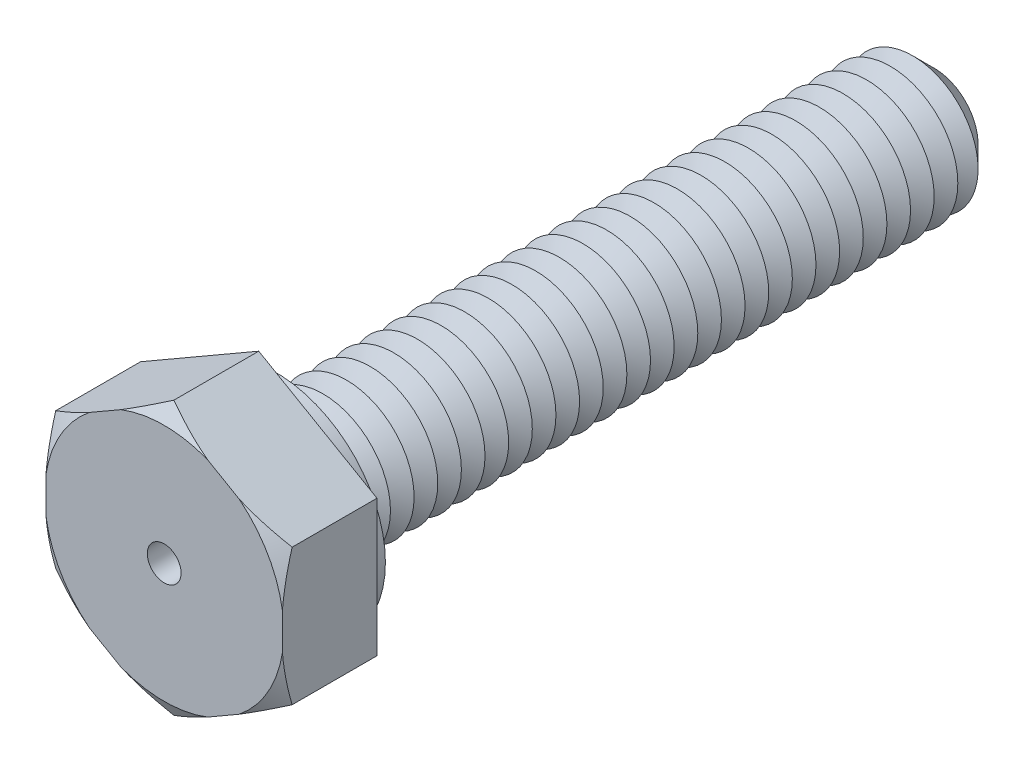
ISO-10303-21;
HEADER;
FILE_DESCRIPTION(('STEP AP214'),'2;1');
FILE_NAME('part.step','',(''),(''),'','','');
FILE_SCHEMA(('AUTOMOTIVE_DESIGN { 1 0 10303 214 1 1 1 1 }'));
ENDSEC;
DATA;
#1=APPLICATION_CONTEXT('core data for automotive mechanical design processes');
#2=APPLICATION_PROTOCOL_DEFINITION('international standard','automotive_design',2000,#1);
#3=PRODUCT_CONTEXT('',#1,'mechanical');
#4=PRODUCT('Part','Part','',(#3));
#5=PRODUCT_RELATED_PRODUCT_CATEGORY('part','',(#4));
#6=PRODUCT_DEFINITION_FORMATION('','',#4);
#7=PRODUCT_DEFINITION_CONTEXT('part definition',#1,'design');
#8=PRODUCT_DEFINITION('design','',#6,#7);
#9=PRODUCT_DEFINITION_SHAPE('','',#8);
#10=(LENGTH_UNIT() NAMED_UNIT(*) SI_UNIT(.MILLI.,.METRE.));
#11=(NAMED_UNIT(*) PLANE_ANGLE_UNIT() SI_UNIT($,.RADIAN.));
#12=(NAMED_UNIT(*) SI_UNIT($,.STERADIAN.) SOLID_ANGLE_UNIT());
#13=UNCERTAINTY_MEASURE_WITH_UNIT(LENGTH_MEASURE(1.E-05),#10,'distance_accuracy_value','');
#14=(GEOMETRIC_REPRESENTATION_CONTEXT(3) GLOBAL_UNCERTAINTY_ASSIGNED_CONTEXT((#13)) GLOBAL_UNIT_ASSIGNED_CONTEXT((#10,
#11,#12)) REPRESENTATION_CONTEXT('',''));
#15=CARTESIAN_POINT('',(0.,0.,0.));
#16=DIRECTION('',(0.,0.,1.));
#17=DIRECTION('',(1.,0.,0.));
#18=AXIS2_PLACEMENT_3D('',#15,#16,#17);
#19=CARTESIAN_POINT('',(3.5,2.02072594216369,2.8));
#20=DIRECTION('',(-0.5,-0.866025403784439,0.));
#21=DIRECTION('',(0.866025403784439,-0.5,0.));
#22=AXIS2_PLACEMENT_3D('',#19,#20,#21);
#23=PLANE('',#22);
#24=CARTESIAN_POINT('',(5.93124915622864,0.617043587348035,1.40176894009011));
#25=CARTESIAN_POINT('',(5.82127624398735,0.680536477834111,1.46111507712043));
#26=CARTESIAN_POINT('',(5.71104026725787,0.744181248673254,1.51982121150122));
#27=CARTESIAN_POINT('',(5.48993126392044,0.871838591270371,1.63565294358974));
#28=CARTESIAN_POINT('',(5.37905815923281,0.935851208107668,1.69277834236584));
#29=CARTESIAN_POINT('',(5.15623473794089,1.06449837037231,1.80531321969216));
#30=CARTESIAN_POINT('',(5.04428210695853,1.12913425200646,1.86071660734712));
#31=CARTESIAN_POINT('',(4.81953834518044,1.25889012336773,1.96920237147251));
#32=CARTESIAN_POINT('',(4.70674724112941,1.32401009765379,2.02228482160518));
#33=CARTESIAN_POINT('',(4.4773029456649,1.45647982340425,2.12693843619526));
#34=CARTESIAN_POINT('',(4.3606246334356,1.52384407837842,2.17843650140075));
#35=CARTESIAN_POINT('',(4.12610336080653,1.65924499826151,2.27776074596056));
#36=CARTESIAN_POINT('',(4.00826046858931,1.72728162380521,2.32558713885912));
#37=CARTESIAN_POINT('',(3.77136592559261,1.86405275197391,2.41666718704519));
#38=CARTESIAN_POINT('',(3.65231548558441,1.93278655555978,2.45992500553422));
#39=CARTESIAN_POINT('',(3.41281068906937,2.07106471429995,2.54086522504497));
#40=CARTESIAN_POINT('',(3.29235651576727,2.14060896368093,2.57854834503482));
#41=CARTESIAN_POINT('',(3.00433211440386,2.30689992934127,2.66006219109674));
#42=CARTESIAN_POINT('',(2.83610127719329,2.40402804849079,2.70086381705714));
#43=CARTESIAN_POINT('',(2.49725085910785,2.59966342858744,2.76622673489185));
#44=CARTESIAN_POINT('',(2.32663213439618,2.69817019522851,2.79079370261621));
#45=CARTESIAN_POINT('',(2.07079150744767,2.84587985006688,2.81342200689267));
#46=CARTESIAN_POINT('',(1.98601608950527,2.89482496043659,2.8186046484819));
#47=CARTESIAN_POINT('',(1.81634230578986,2.9927861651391,2.82423615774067));
#48=CARTESIAN_POINT('',(1.73144394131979,3.04180225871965,2.82468507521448));
#49=CARTESIAN_POINT('',(1.56172682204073,3.13978848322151,2.82082792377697));
#50=CARTESIAN_POINT('',(1.47690807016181,3.18875861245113,2.81652168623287));
#51=CARTESIAN_POINT('',(1.30753953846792,3.28654357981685,2.80328667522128));
#52=CARTESIAN_POINT('',(1.22298977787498,3.3353584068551,2.79435757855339));
#53=CARTESIAN_POINT('',(1.02330750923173,3.45064501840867,2.76803629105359));
#54=CARTESIAN_POINT('',(0.90836188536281,3.51700890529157,2.7487394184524));
#55=CARTESIAN_POINT('',(0.679569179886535,3.64910243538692,2.70286231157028));
#56=CARTESIAN_POINT('',(0.565722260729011,3.71483198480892,2.67628101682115));
#57=CARTESIAN_POINT('',(0.339141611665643,3.84564838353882,2.61683846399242));
#58=CARTESIAN_POINT('',(0.226409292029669,3.91073441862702,2.58397011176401));
#59=CARTESIAN_POINT('',(0.00220965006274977,4.04017614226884,2.512988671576));
#60=CARTESIAN_POINT('',(-0.109257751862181,4.10453187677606,2.47487591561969));
#61=CARTESIAN_POINT('',(-0.332327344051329,4.23332116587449,2.39383232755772));
#62=CARTESIAN_POINT('',(-0.443915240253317,4.29774646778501,2.35084938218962));
#63=CARTESIAN_POINT('',(-0.665905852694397,4.42591280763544,2.26126522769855));
#64=CARTESIAN_POINT('',(-0.776309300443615,4.48965426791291,2.2146664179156));
#65=CARTESIAN_POINT('',(-1.10600622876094,4.68000487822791,2.07044134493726));
#66=CARTESIAN_POINT('',(-1.32384189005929,4.80577235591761,1.96836549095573));
#67=CARTESIAN_POINT('',(-1.61545494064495,4.97413522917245,1.82536950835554));
#68=CARTESIAN_POINT('',(-1.69056073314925,5.01749757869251,1.78796601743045));
#69=CARTESIAN_POINT('',(-1.84044297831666,5.10403213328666,1.71229146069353));
#70=CARTESIAN_POINT('',(-1.91521944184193,5.14720434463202,1.67402042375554));
#71=CARTESIAN_POINT('',(-2.06368614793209,5.23292163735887,1.59712633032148));
#72=CARTESIAN_POINT('',(-2.13737951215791,5.27546852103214,1.55851128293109));
#73=CARTESIAN_POINT('',(-2.28450431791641,5.36041106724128,1.48061736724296));
#74=CARTESIAN_POINT('',(-2.35793575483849,5.40280672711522,1.44133848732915));
#75=CARTESIAN_POINT('',(-2.43124915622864,5.44513423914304,1.40176894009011));
#76=B_SPLINE_CURVE_WITH_KNOTS('',3,(#24,#25,#26,#27,#28,#29,#30,#31,#32,#33,#34,#35,#36,#37,#38,
#39,#40,#41,#42,#43,#44,#45,#46,#47,#48,#49,#50,#51,#52,#53,#54,#55,#56,#57,#58,#59,#60,#61,#62,
#63,#64,#65,#66,#67,#68,#69,#70,#71,#72,#73,#74,#75),.UNSPECIFIED.,.F.,.F.,(4,2,2,2,2,2,2,2,2,2,
2,2,2,2,2,2,2,2,2,2,2,2,2,2,2,4),(0.,0.420511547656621,0.841075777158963,1.26298883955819,
1.68488850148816,2.11755106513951,2.55018844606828,2.98242811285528,3.41461198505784,
4.0095520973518,4.60428410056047,4.89826759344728,5.19224799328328,5.48623881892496,
5.78025020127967,6.1823765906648,6.58456155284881,6.98720303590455,7.3898190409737,
7.7972442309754,8.20440134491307,9.01851321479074,9.30185450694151,9.58518638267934,
9.86552040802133,10.1458593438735),.UNSPECIFIED.);
#77=CARTESIAN_POINT('',(3.5,2.02072594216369,2.51132486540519));
#78=VERTEX_POINT('',#77);
#79=CARTESIAN_POINT('',(2.2178793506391,2.76095864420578,2.8));
#80=VERTEX_POINT('',#79);
#81=EDGE_CURVE('E132',#78,#80,#76,.T.);
#82=ORIENTED_EDGE('',*,*,#81,.F.);
#83=DIRECTION('',(0.,0.,-1.));
#84=VECTOR('',#83,1.);
#85=CARTESIAN_POINT('',(3.5,2.02072594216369,2.8));
#86=LINE('',#85,#84);
#87=CARTESIAN_POINT('',(3.5,2.02072594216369,0.));
#88=VERTEX_POINT('',#87);
#89=EDGE_CURVE('E144',#78,#88,#86,.T.);
#90=ORIENTED_EDGE('',*,*,#89,.T.);
#91=DIRECTION('',(-0.866025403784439,0.5,0.));
#92=VECTOR('',#91,1.);
#93=CARTESIAN_POINT('',(3.5,2.02072594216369,0.));
#94=LINE('',#93,#92);
#95=CARTESIAN_POINT('',(0.,4.04145188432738,0.));
#96=VERTEX_POINT('',#95);
#97=EDGE_CURVE('E417',#88,#96,#94,.T.);
#98=ORIENTED_EDGE('',*,*,#97,.T.);
#99=DIRECTION('',(0.,0.,-1.));
#100=VECTOR('',#99,1.);
#101=CARTESIAN_POINT('',(0.,4.04145188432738,2.8));
#102=LINE('',#101,#100);
#103=CARTESIAN_POINT('',(0.,4.04145188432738,2.51132486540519));
#104=VERTEX_POINT('',#103);
#105=EDGE_CURVE('E179',#104,#96,#102,.T.);
#106=ORIENTED_EDGE('',*,*,#105,.F.);
#107=CARTESIAN_POINT('',(1.2821206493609,3.30121918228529,2.8));
#108=VERTEX_POINT('',#107);
#109=EDGE_CURVE('E151',#108,#104,#76,.T.);
#110=ORIENTED_EDGE('',*,*,#109,.F.);
#111=DIRECTION('',(-0.866025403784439,0.5,0.));
#112=VECTOR('',#111,1.);
#113=CARTESIAN_POINT('',(3.5,2.02072594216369,2.8));
#114=LINE('',#113,#112);
#115=EDGE_CURVE('E148',#80,#108,#114,.T.);
#116=ORIENTED_EDGE('',*,*,#115,.F.);
#117=EDGE_LOOP('',(#82,#90,#98,#106,#110,#116));
#118=FACE_BOUND('',#117,.T.);
#119=ADVANCED_FACE('F39',(#118),#23,.F.);
#120=CARTESIAN_POINT('',(0.,4.04145188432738,2.8));
#121=DIRECTION('',(0.5,-0.866025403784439,0.));
#122=DIRECTION('',(0.866025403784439,0.5,0.));
#123=AXIS2_PLACEMENT_3D('',#120,#121,#122);
#124=PLANE('',#123);
#125=CARTESIAN_POINT('',(2.43124915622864,5.44513423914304,1.4017689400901));
#126=CARTESIAN_POINT('',(2.32127624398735,5.38164134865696,1.46111507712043));
#127=CARTESIAN_POINT('',(2.21104026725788,5.31799657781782,1.51982121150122));
#128=CARTESIAN_POINT('',(1.98993126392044,5.1903392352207,1.63565294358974));
#129=CARTESIAN_POINT('',(1.87905815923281,5.1263266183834,1.69277834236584));
#130=CARTESIAN_POINT('',(1.65623473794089,4.99767945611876,1.80531321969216));
#131=CARTESIAN_POINT('',(1.54428210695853,4.93304357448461,1.86071660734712));
#132=CARTESIAN_POINT('',(1.31953834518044,4.80328770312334,1.96920237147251));
#133=CARTESIAN_POINT('',(1.20674724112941,4.73816772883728,2.02228482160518));
#134=CARTESIAN_POINT('',(0.977302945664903,4.60569800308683,2.12693843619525));
#135=CARTESIAN_POINT('',(0.860624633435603,4.53833374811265,2.17843650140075));
#136=CARTESIAN_POINT('',(0.626103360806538,4.40293282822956,2.27776074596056));
#137=CARTESIAN_POINT('',(0.50826046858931,4.33489620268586,2.32558713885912));
#138=CARTESIAN_POINT('',(0.271365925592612,4.19812507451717,2.41666718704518));
#139=CARTESIAN_POINT('',(0.152315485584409,4.12939127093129,2.45992500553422));
#140=CARTESIAN_POINT('',(-0.0871893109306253,3.99111311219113,2.54086522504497));
#141=CARTESIAN_POINT('',(-0.207643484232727,3.92156886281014,2.57854834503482));
#142=CARTESIAN_POINT('',(-0.495667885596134,3.7552778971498,2.66006219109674));
#143=CARTESIAN_POINT('',(-0.663898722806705,3.65814977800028,2.70086381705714));
#144=CARTESIAN_POINT('',(-1.00274914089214,3.46251439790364,2.76622673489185));
#145=CARTESIAN_POINT('',(-1.17336786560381,3.36400763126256,2.79079370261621));
#146=CARTESIAN_POINT('',(-1.42920849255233,3.21629797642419,2.81342200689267));
#147=CARTESIAN_POINT('',(-1.51398391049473,3.16735286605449,2.8186046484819));
#148=CARTESIAN_POINT('',(-1.68365769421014,3.06939166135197,2.82423615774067));
#149=CARTESIAN_POINT('',(-1.7685560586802,3.02037556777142,2.82468507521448));
#150=CARTESIAN_POINT('',(-1.93827317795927,2.92238934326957,2.82082792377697));
#151=CARTESIAN_POINT('',(-2.02309192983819,2.87341921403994,2.81652168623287));
#152=CARTESIAN_POINT('',(-2.19246046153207,2.77563424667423,2.80328667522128));
#153=CARTESIAN_POINT('',(-2.27701022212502,2.72681941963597,2.79435757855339));
#154=CARTESIAN_POINT('',(-2.47669249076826,2.6115328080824,2.76803629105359));
#155=CARTESIAN_POINT('',(-2.59163811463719,2.54516892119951,2.7487394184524));
#156=CARTESIAN_POINT('',(-2.82043082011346,2.41307539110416,2.70286231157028));
#157=CARTESIAN_POINT('',(-2.93427773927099,2.34734584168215,2.67628101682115));
#158=CARTESIAN_POINT('',(-3.16085838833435,2.21652944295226,2.61683846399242));
#159=CARTESIAN_POINT('',(-3.27359070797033,2.15144340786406,2.58397011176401));
#160=CARTESIAN_POINT('',(-3.49779034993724,2.02200168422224,2.512988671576));
#161=CARTESIAN_POINT('',(-3.60925775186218,1.95764594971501,2.47487591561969));
#162=CARTESIAN_POINT('',(-3.83232734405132,1.82885666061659,2.39383232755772));
#163=CARTESIAN_POINT('',(-3.94391524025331,1.76443135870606,2.35084938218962));
#164=CARTESIAN_POINT('',(-4.16590585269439,1.63626501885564,2.26126522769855));
#165=CARTESIAN_POINT('',(-4.27630930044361,1.57252355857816,2.21466641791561));
#166=CARTESIAN_POINT('',(-4.60600622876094,1.38217294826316,2.07044134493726));
#167=CARTESIAN_POINT('',(-4.82384189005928,1.25640547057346,1.96836549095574));
#168=CARTESIAN_POINT('',(-5.11545494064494,1.08804259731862,1.82536950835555));
#169=CARTESIAN_POINT('',(-5.19056073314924,1.04468024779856,1.78796601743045));
#170=CARTESIAN_POINT('',(-5.34044297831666,0.958145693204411,1.71229146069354));
#171=CARTESIAN_POINT('',(-5.41521944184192,0.914973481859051,1.67402042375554));
#172=CARTESIAN_POINT('',(-5.56368614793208,0.829256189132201,1.59712633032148));
#173=CARTESIAN_POINT('',(-5.6373795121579,0.786709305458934,1.55851128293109));
#174=CARTESIAN_POINT('',(-5.78450431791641,0.701766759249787,1.48061736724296));
#175=CARTESIAN_POINT('',(-5.85793575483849,0.659371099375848,1.44133848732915));
#176=CARTESIAN_POINT('',(-5.93124915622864,0.617043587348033,1.40176894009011));
#177=B_SPLINE_CURVE_WITH_KNOTS('',3,(#125,#126,#127,#128,#129,#130,#131,#132,#133,#134,#135,
#136,#137,#138,#139,#140,#141,#142,#143,#144,#145,#146,#147,#148,#149,#150,#151,#152,#153,#154,
#155,#156,#157,#158,#159,#160,#161,#162,#163,#164,#165,#166,#167,#168,#169,#170,#171,#172,#173,
#174,#175,#176),.UNSPECIFIED.,.F.,.F.,(4,2,2,2,2,2,2,2,2,2,2,2,2,2,2,2,2,2,2,2,2,2,2,2,2,4),(0.,
0.420511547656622,0.841075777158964,1.26298883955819,1.68488850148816,2.11755106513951,
2.55018844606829,2.98242811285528,3.41461198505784,4.0095520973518,4.60428410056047,
4.89826759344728,5.19224799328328,5.48623881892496,5.78025020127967,6.1823765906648,
6.58456155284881,6.98720303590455,7.3898190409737,7.7972442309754,8.20440134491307,
9.01851321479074,9.30185450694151,9.58518638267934,9.86552040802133,10.1458593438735),.UNSPECIFIED.);
#178=CARTESIAN_POINT('',(-1.2821206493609,3.30121918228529,2.8));
#179=VERTEX_POINT('',#178);
#180=EDGE_CURVE('E466',#104,#179,#177,.T.);
#181=ORIENTED_EDGE('',*,*,#180,.F.);
#182=ORIENTED_EDGE('',*,*,#105,.T.);
#183=DIRECTION('',(-0.866025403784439,-0.5,0.));
#184=VECTOR('',#183,1.);
#185=CARTESIAN_POINT('',(0.,4.04145188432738,0.));
#186=LINE('',#185,#184);
#187=CARTESIAN_POINT('',(-3.5,2.02072594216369,0.));
#188=VERTEX_POINT('',#187);
#189=EDGE_CURVE('E437',#96,#188,#186,.T.);
#190=ORIENTED_EDGE('',*,*,#189,.T.);
#191=DIRECTION('',(0.,0.,-1.));
#192=VECTOR('',#191,1.);
#193=CARTESIAN_POINT('',(-3.5,2.02072594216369,2.8));
#194=LINE('',#193,#192);
#195=CARTESIAN_POINT('',(-3.5,2.02072594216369,2.51132486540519));
#196=VERTEX_POINT('',#195);
#197=EDGE_CURVE('E176',#196,#188,#194,.T.);
#198=ORIENTED_EDGE('',*,*,#197,.F.);
#199=CARTESIAN_POINT('',(-2.2178793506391,2.76095864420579,2.8));
#200=VERTEX_POINT('',#199);
#201=EDGE_CURVE('E467',#200,#196,#177,.T.);
#202=ORIENTED_EDGE('',*,*,#201,.F.);
#203=DIRECTION('',(-0.866025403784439,-0.5,0.));
#204=VECTOR('',#203,1.);
#205=CARTESIAN_POINT('',(0.,4.04145188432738,2.8));
#206=LINE('',#205,#204);
#207=EDGE_CURVE('E420',#179,#200,#206,.T.);
#208=ORIENTED_EDGE('',*,*,#207,.F.);
#209=EDGE_LOOP('',(#181,#182,#190,#198,#202,#208));
#210=FACE_BOUND('',#209,.T.);
#211=ADVANCED_FACE('F541',(#210),#124,.F.);
#212=CARTESIAN_POINT('',(-3.5,2.02072594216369,2.8));
#213=DIRECTION('',(1.,0.,0.));
#214=DIRECTION('',(0.,1.,0.));
#215=AXIS2_PLACEMENT_3D('',#212,#213,#214);
#216=PLANE('',#215);
#217=CARTESIAN_POINT('',(-3.5,4.45197509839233,1.57509745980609));
#218=CARTESIAN_POINT('',(-3.5,4.32552348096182,1.632476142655));
#219=CARTESIAN_POINT('',(-3.5,4.19872625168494,1.68910722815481));
#220=CARTESIAN_POINT('',(-3.5,3.94429210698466,1.80051165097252));
#221=CARTESIAN_POINT('',(-3.5,3.81665504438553,1.85528465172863));
#222=CARTESIAN_POINT('',(-3.5,3.55990351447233,1.96281335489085));
#223=CARTESIAN_POINT('',(-3.5,3.43078510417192,2.01555968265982));
#224=CARTESIAN_POINT('',(-3.5,3.17145843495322,2.11829034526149));
#225=CARTESIAN_POINT('',(-3.5,3.04125022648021,2.16827480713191));
#226=CARTESIAN_POINT('',(-3.5,2.78016103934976,2.26465408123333));
#227=CARTESIAN_POINT('',(-3.5,2.64928566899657,2.31106393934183));
#228=CARTESIAN_POINT('',(-3.5,2.38615329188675,2.39977727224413));
#229=CARTESIAN_POINT('',(-3.5,2.25389619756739,2.44208048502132));
#230=CARTESIAN_POINT('',(-3.5,1.85519063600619,2.56138283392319));
#231=CARTESIAN_POINT('',(-3.5,1.58637912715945,2.63093897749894));
#232=CARTESIAN_POINT('',(-3.5,1.11975855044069,2.72563856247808));
#233=CARTESIAN_POINT('',(-3.5,0.923391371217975,2.75778053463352));
#234=CARTESIAN_POINT('',(-3.5,0.528527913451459,2.80406409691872));
#235=CARTESIAN_POINT('',(-3.5,0.330032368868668,2.81821170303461));
#236=CARTESIAN_POINT('',(-3.5,-0.0672968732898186,2.82680706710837));
#237=CARTESIAN_POINT('',(-3.5,-0.266130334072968,2.82126532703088));
#238=CARTESIAN_POINT('',(-3.5,-0.662321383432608,2.79120496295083));
#239=CARTESIAN_POINT('',(-3.5,-0.859678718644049,2.76668315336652));
#240=CARTESIAN_POINT('',(-3.5,-1.34971804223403,2.68500356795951));
#241=CARTESIAN_POINT('',(-3.5,-1.64068160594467,2.61765497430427));
#242=CARTESIAN_POINT('',(-3.5,-2.07181303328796,2.497569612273));
#243=CARTESIAN_POINT('',(-3.5,-2.21482517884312,2.45429352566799));
#244=CARTESIAN_POINT('',(-3.5,-2.49919378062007,2.36258423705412));
#245=CARTESIAN_POINT('',(-3.5,-2.64055035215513,2.31415139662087));
#246=CARTESIAN_POINT('',(-3.5,-2.92337235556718,2.2125676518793));
#247=CARTESIAN_POINT('',(-3.5,-3.06482042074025,2.15936898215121));
#248=CARTESIAN_POINT('',(-3.5,-3.34639535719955,2.04956763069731));
#249=CARTESIAN_POINT('',(-3.5,-3.48652214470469,1.99296473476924));
#250=CARTESIAN_POINT('',(-3.5,-3.76476497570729,1.87738368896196));
#251=CARTESIAN_POINT('',(-3.5,-3.90288810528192,1.81842250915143));
#252=CARTESIAN_POINT('',(-3.5,-4.1781332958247,1.6982956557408));
#253=CARTESIAN_POINT('',(-3.5,-4.31525559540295,1.6371305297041));
#254=CARTESIAN_POINT('',(-3.5,-4.45197509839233,1.57509745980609));
#255=B_SPLINE_CURVE_WITH_KNOTS('',3,(#217,#218,#219,#220,#221,#222,#223,#224,#225,#226,#227,
#228,#229,#230,#231,#232,#233,#234,#235,#236,#237,#238,#239,#240,#241,#242,#243,#244,#245,#246,
#247,#248,#249,#250,#251,#252,#253,#254),.UNSPECIFIED.,.F.,.F.,(4,2,2,2,2,2,2,2,2,2,2,2,2,2,2,2,
2,2,4),(0.,0.416588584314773,0.83325222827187,1.251655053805,1.67003861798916,2.08655215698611,
2.50309225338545,3.3347974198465,3.93106101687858,4.52712521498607,5.12287153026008,
5.71871785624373,6.61272902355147,7.06093271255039,7.50910499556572,7.9624204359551,
8.41576442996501,8.86628772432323,9.31669984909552),.UNSPECIFIED.);
#256=CARTESIAN_POINT('',(-3.5,0.540260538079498,2.8));
#257=VERTEX_POINT('',#256);
#258=EDGE_CURVE('E532',#196,#257,#255,.T.);
#259=ORIENTED_EDGE('',*,*,#258,.F.);
#260=ORIENTED_EDGE('',*,*,#197,.T.);
#261=DIRECTION('',(0.,-1.,0.));
#262=VECTOR('',#261,1.);
#263=CARTESIAN_POINT('',(-3.5,2.02072594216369,0.));
#264=LINE('',#263,#262);
#265=CARTESIAN_POINT('',(-3.5,-2.02072594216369,0.));
#266=VERTEX_POINT('',#265);
#267=EDGE_CURVE('E441',#188,#266,#264,.T.);
#268=ORIENTED_EDGE('',*,*,#267,.T.);
#269=DIRECTION('',(0.,0.,-1.));
#270=VECTOR('',#269,1.);
#271=CARTESIAN_POINT('',(-3.5,-2.02072594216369,2.8));
#272=LINE('',#271,#270);
#273=CARTESIAN_POINT('',(-3.5,-2.02072594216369,2.51132486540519));
#274=VERTEX_POINT('',#273);
#275=EDGE_CURVE('E173',#274,#266,#272,.T.);
#276=ORIENTED_EDGE('',*,*,#275,.F.);
#277=CARTESIAN_POINT('',(-3.5,-0.540260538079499,2.8));
#278=VERTEX_POINT('',#277);
#279=EDGE_CURVE('E463',#278,#274,#255,.T.);
#280=ORIENTED_EDGE('',*,*,#279,.F.);
#281=DIRECTION('',(0.,-1.,0.));
#282=VECTOR('',#281,1.);
#283=CARTESIAN_POINT('',(-3.5,2.02072594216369,2.8));
#284=LINE('',#283,#282);
#285=EDGE_CURVE('E424',#257,#278,#284,.T.);
#286=ORIENTED_EDGE('',*,*,#285,.F.);
#287=EDGE_LOOP('',(#259,#260,#268,#276,#280,#286));
#288=FACE_BOUND('',#287,.T.);
#289=ADVANCED_FACE('F537',(#288),#216,.F.);
#290=CARTESIAN_POINT('',(-3.5,-2.02072594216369,2.8));
#291=DIRECTION('',(0.5,0.866025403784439,0.));
#292=DIRECTION('',(-0.866025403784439,0.5,0.));
#293=AXIS2_PLACEMENT_3D('',#290,#291,#292);
#294=PLANE('',#293);
#295=CARTESIAN_POINT('',(-5.93124915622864,-0.617043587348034,1.4017689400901));
#296=CARTESIAN_POINT('',(-5.82127624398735,-0.68053647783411,1.46111507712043));
#297=CARTESIAN_POINT('',(-5.71104026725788,-0.744181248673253,1.51982121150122));
#298=CARTESIAN_POINT('',(-5.48993126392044,-0.87183859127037,1.63565294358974));
#299=CARTESIAN_POINT('',(-5.37905815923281,-0.935851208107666,1.69277834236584));
#300=CARTESIAN_POINT('',(-5.15623473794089,-1.06449837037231,1.80531321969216));
#301=CARTESIAN_POINT('',(-5.04428210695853,-1.12913425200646,1.86071660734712));
#302=CARTESIAN_POINT('',(-4.81953834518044,-1.25889012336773,1.96920237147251));
#303=CARTESIAN_POINT('',(-4.70674724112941,-1.32401009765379,2.02228482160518));
#304=CARTESIAN_POINT('',(-4.4773029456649,-1.45647982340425,2.12693843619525));
#305=CARTESIAN_POINT('',(-4.3606246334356,-1.52384407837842,2.17843650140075));
#306=CARTESIAN_POINT('',(-4.12610336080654,-1.65924499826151,2.27776074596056));
#307=CARTESIAN_POINT('',(-4.00826046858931,-1.72728162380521,2.32558713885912));
#308=CARTESIAN_POINT('',(-3.77136592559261,-1.8640527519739,2.41666718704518));
#309=CARTESIAN_POINT('',(-3.65231548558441,-1.93278655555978,2.45992500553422));
#310=CARTESIAN_POINT('',(-3.41281068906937,-2.07106471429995,2.54086522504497));
#311=CARTESIAN_POINT('',(-3.29235651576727,-2.14060896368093,2.57854834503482));
#312=CARTESIAN_POINT('',(-3.00433211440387,-2.30689992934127,2.66006219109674));
#313=CARTESIAN_POINT('',(-2.83610127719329,-2.40402804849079,2.70086381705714));
#314=CARTESIAN_POINT('',(-2.49725085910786,-2.59966342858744,2.76622673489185));
#315=CARTESIAN_POINT('',(-2.32663213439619,-2.69817019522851,2.79079370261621));
#316=CARTESIAN_POINT('',(-2.07079150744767,-2.84587985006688,2.81342200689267));
#317=CARTESIAN_POINT('',(-1.98601608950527,-2.89482496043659,2.8186046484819));
#318=CARTESIAN_POINT('',(-1.81634230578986,-2.9927861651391,2.82423615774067));
#319=CARTESIAN_POINT('',(-1.7314439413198,-3.04180225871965,2.82468507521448));
#320=CARTESIAN_POINT('',(-1.56172682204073,-3.13978848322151,2.82082792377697));
#321=CARTESIAN_POINT('',(-1.47690807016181,-3.18875861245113,2.81652168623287));
#322=CARTESIAN_POINT('',(-1.30753953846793,-3.28654357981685,2.80328667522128));
#323=CARTESIAN_POINT('',(-1.22298977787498,-3.3353584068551,2.79435757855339));
#324=CARTESIAN_POINT('',(-1.02330750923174,-3.45064501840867,2.76803629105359));
#325=CARTESIAN_POINT('',(-0.908361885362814,-3.51700890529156,2.7487394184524));
#326=CARTESIAN_POINT('',(-0.679569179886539,-3.64910243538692,2.70286231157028));
#327=CARTESIAN_POINT('',(-0.565722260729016,-3.71483198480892,2.67628101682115));
#328=CARTESIAN_POINT('',(-0.339141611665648,-3.84564838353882,2.61683846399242));
#329=CARTESIAN_POINT('',(-0.226409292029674,-3.91073441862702,2.58397011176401));
#330=CARTESIAN_POINT('',(-0.00220965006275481,-4.04017614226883,2.512988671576));
#331=CARTESIAN_POINT('',(0.109257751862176,-4.10453187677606,2.47487591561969));
#332=CARTESIAN_POINT('',(0.332327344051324,-4.23332116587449,2.39383232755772));
#333=CARTESIAN_POINT('',(0.443915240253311,-4.29774646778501,2.35084938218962));
#334=CARTESIAN_POINT('',(0.665905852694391,-4.42591280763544,2.26126522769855));
#335=CARTESIAN_POINT('',(0.776309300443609,-4.48965426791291,2.2146664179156));
#336=CARTESIAN_POINT('',(1.10600622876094,-4.68000487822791,2.07044134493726));
#337=CARTESIAN_POINT('',(1.32384189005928,-4.80577235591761,1.96836549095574));
#338=CARTESIAN_POINT('',(1.61545494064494,-4.97413522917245,1.82536950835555));
#339=CARTESIAN_POINT('',(1.69056073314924,-5.01749757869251,1.78796601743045));
#340=CARTESIAN_POINT('',(1.84044297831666,-5.10403213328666,1.71229146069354));
#341=CARTESIAN_POINT('',(1.91521944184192,-5.14720434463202,1.67402042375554));
#342=CARTESIAN_POINT('',(2.06368614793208,-5.23292163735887,1.59712633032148));
#343=CARTESIAN_POINT('',(2.1373795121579,-5.27546852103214,1.55851128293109));
#344=CARTESIAN_POINT('',(2.28450431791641,-5.36041106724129,1.48061736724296));
#345=CARTESIAN_POINT('',(2.35793575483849,-5.40280672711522,1.44133848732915));
#346=CARTESIAN_POINT('',(2.43124915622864,-5.44513423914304,1.40176894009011));
#347=B_SPLINE_CURVE_WITH_KNOTS('',3,(#295,#296,#297,#298,#299,#300,#301,#302,#303,#304,#305,
#306,#307,#308,#309,#310,#311,#312,#313,#314,#315,#316,#317,#318,#319,#320,#321,#322,#323,#324,
#325,#326,#327,#328,#329,#330,#331,#332,#333,#334,#335,#336,#337,#338,#339,#340,#341,#342,#343,
#344,#345,#346),.UNSPECIFIED.,.F.,.F.,(4,2,2,2,2,2,2,2,2,2,2,2,2,2,2,2,2,2,2,2,2,2,2,2,2,4),(0.,
0.420511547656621,0.841075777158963,1.26298883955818,1.68488850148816,2.11755106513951,
2.55018844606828,2.98242811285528,3.41461198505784,4.00955209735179,4.60428410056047,
4.89826759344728,5.19224799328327,5.48623881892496,5.78025020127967,6.1823765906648,
6.58456155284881,6.98720303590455,7.38981904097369,7.7972442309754,8.20440134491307,
9.01851321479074,9.30185450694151,9.58518638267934,9.86552040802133,10.1458593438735),.UNSPECIFIED.);
#348=CARTESIAN_POINT('',(-2.2178793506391,-2.76095864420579,2.8));
#349=VERTEX_POINT('',#348);
#350=EDGE_CURVE('E461',#274,#349,#347,.T.);
#351=ORIENTED_EDGE('',*,*,#350,.F.);
#352=ORIENTED_EDGE('',*,*,#275,.T.);
#353=DIRECTION('',(0.866025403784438,-0.5,0.));
#354=VECTOR('',#353,1.);
#355=CARTESIAN_POINT('',(-3.5,-2.02072594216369,0.));
#356=LINE('',#355,#354);
#357=CARTESIAN_POINT('',(0.,-4.04145188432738,0.));
#358=VERTEX_POINT('',#357);
#359=EDGE_CURVE('E445',#266,#358,#356,.T.);
#360=ORIENTED_EDGE('',*,*,#359,.T.);
#361=DIRECTION('',(0.,0.,-1.));
#362=VECTOR('',#361,1.);
#363=CARTESIAN_POINT('',(0.,-4.04145188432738,2.8));
#364=LINE('',#363,#362);
#365=CARTESIAN_POINT('',(0.,-4.04145188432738,2.51132486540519));
#366=VERTEX_POINT('',#365);
#367=EDGE_CURVE('E163',#366,#358,#364,.T.);
#368=ORIENTED_EDGE('',*,*,#367,.F.);
#369=CARTESIAN_POINT('',(-1.2821206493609,-3.30121918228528,2.8));
#370=VERTEX_POINT('',#369);
#371=EDGE_CURVE('E464',#370,#366,#347,.T.);
#372=ORIENTED_EDGE('',*,*,#371,.F.);
#373=DIRECTION('',(0.866025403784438,-0.5,0.));
#374=VECTOR('',#373,1.);
#375=CARTESIAN_POINT('',(-3.5,-2.02072594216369,2.8));
#376=LINE('',#375,#374);
#377=EDGE_CURVE('E428',#349,#370,#376,.T.);
#378=ORIENTED_EDGE('',*,*,#377,.F.);
#379=EDGE_LOOP('',(#351,#352,#360,#368,#372,#378));
#380=FACE_BOUND('',#379,.T.);
#381=ADVANCED_FACE('F540',(#380),#294,.F.);
#382=CARTESIAN_POINT('',(0.,-4.04145188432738,2.8));
#383=DIRECTION('',(-0.5,0.866025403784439,0.));
#384=DIRECTION('',(-0.866025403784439,-0.5,0.));
#385=AXIS2_PLACEMENT_3D('',#382,#383,#384);
#386=PLANE('',#385);
#387=CARTESIAN_POINT('',(-2.43124915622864,-5.44513423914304,1.4017689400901));
#388=CARTESIAN_POINT('',(-2.32127624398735,-5.38164134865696,1.46111507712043));
#389=CARTESIAN_POINT('',(-2.21104026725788,-5.31799657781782,1.51982121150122));
#390=CARTESIAN_POINT('',(-1.98993126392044,-5.1903392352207,1.63565294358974));
#391=CARTESIAN_POINT('',(-1.87905815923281,-5.1263266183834,1.69277834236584));
#392=CARTESIAN_POINT('',(-1.65623473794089,-4.99767945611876,1.80531321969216));
#393=CARTESIAN_POINT('',(-1.54428210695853,-4.93304357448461,1.86071660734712));
#394=CARTESIAN_POINT('',(-1.31953834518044,-4.80328770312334,1.96920237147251));
#395=CARTESIAN_POINT('',(-1.20674724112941,-4.73816772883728,2.02228482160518));
#396=CARTESIAN_POINT('',(-0.977302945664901,-4.60569800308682,2.12693843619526));
#397=CARTESIAN_POINT('',(-0.860624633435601,-4.53833374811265,2.17843650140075));
#398=CARTESIAN_POINT('',(-0.626103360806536,-4.40293282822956,2.27776074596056));
#399=CARTESIAN_POINT('',(-0.508260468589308,-4.33489620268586,2.32558713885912));
#400=CARTESIAN_POINT('',(-0.27136592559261,-4.19812507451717,2.41666718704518));
#401=CARTESIAN_POINT('',(-0.152315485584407,-4.12939127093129,2.45992500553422));
#402=CARTESIAN_POINT('',(0.0871893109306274,-3.99111311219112,2.54086522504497));
#403=CARTESIAN_POINT('',(0.20764348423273,-3.92156886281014,2.57854834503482));
#404=CARTESIAN_POINT('',(0.495667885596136,-3.7552778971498,2.66006219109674));
#405=CARTESIAN_POINT('',(0.663898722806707,-3.65814977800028,2.70086381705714));
#406=CARTESIAN_POINT('',(1.00274914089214,-3.46251439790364,2.76622673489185));
#407=CARTESIAN_POINT('',(1.17336786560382,-3.36400763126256,2.79079370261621));
#408=CARTESIAN_POINT('',(1.42920849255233,-3.21629797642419,2.81342200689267));
#409=CARTESIAN_POINT('',(1.51398391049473,-3.16735286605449,2.8186046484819));
#410=CARTESIAN_POINT('',(1.68365769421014,-3.06939166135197,2.82423615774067));
#411=CARTESIAN_POINT('',(1.76855605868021,-3.02037556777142,2.82468507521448));
#412=CARTESIAN_POINT('',(1.93827317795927,-2.92238934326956,2.82082792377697));
#413=CARTESIAN_POINT('',(2.02309192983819,-2.87341921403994,2.81652168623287));
#414=CARTESIAN_POINT('',(2.19246046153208,-2.77563424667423,2.80328667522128));
#415=CARTESIAN_POINT('',(2.27701022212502,-2.72681941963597,2.79435757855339));
#416=CARTESIAN_POINT('',(2.47669249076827,-2.6115328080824,2.76803629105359));
#417=CARTESIAN_POINT('',(2.59163811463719,-2.54516892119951,2.7487394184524));
#418=CARTESIAN_POINT('',(2.82043082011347,-2.41307539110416,2.70286231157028));
#419=CARTESIAN_POINT('',(2.93427773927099,-2.34734584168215,2.67628101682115));
#420=CARTESIAN_POINT('',(3.16085838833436,-2.21652944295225,2.61683846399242));
#421=CARTESIAN_POINT('',(3.27359070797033,-2.15144340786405,2.58397011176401));
#422=CARTESIAN_POINT('',(3.49779034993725,-2.02200168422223,2.512988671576));
#423=CARTESIAN_POINT('',(3.60925775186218,-1.95764594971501,2.47487591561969));
#424=CARTESIAN_POINT('',(3.83232734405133,-1.82885666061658,2.39383232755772));
#425=CARTESIAN_POINT('',(3.94391524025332,-1.76443135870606,2.35084938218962));
#426=CARTESIAN_POINT('',(4.1659058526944,-1.63626501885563,2.26126522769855));
#427=CARTESIAN_POINT('',(4.27630930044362,-1.57252355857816,2.2146664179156));
#428=CARTESIAN_POINT('',(4.60600622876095,-1.38217294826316,2.07044134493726));
#429=CARTESIAN_POINT('',(4.82384189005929,-1.25640547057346,1.96836549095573));
#430=CARTESIAN_POINT('',(5.11545494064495,-1.08804259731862,1.82536950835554));
#431=CARTESIAN_POINT('',(5.19056073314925,-1.04468024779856,1.78796601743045));
#432=CARTESIAN_POINT('',(5.34044297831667,-0.95814569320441,1.71229146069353));
#433=CARTESIAN_POINT('',(5.41521944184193,-0.914973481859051,1.67402042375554));
#434=CARTESIAN_POINT('',(5.56368614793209,-0.829256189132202,1.59712633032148));
#435=CARTESIAN_POINT('',(5.63737951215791,-0.786709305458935,1.55851128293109));
#436=CARTESIAN_POINT('',(5.78450431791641,-0.70176675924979,1.48061736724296));
#437=CARTESIAN_POINT('',(5.85793575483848,-0.659371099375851,1.44133848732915));
#438=CARTESIAN_POINT('',(5.93124915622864,-0.617043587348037,1.40176894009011));
#439=B_SPLINE_CURVE_WITH_KNOTS('',3,(#387,#388,#389,#390,#391,#392,#393,#394,#395,#396,#397,
#398,#399,#400,#401,#402,#403,#404,#405,#406,#407,#408,#409,#410,#411,#412,#413,#414,#415,#416,
#417,#418,#419,#420,#421,#422,#423,#424,#425,#426,#427,#428,#429,#430,#431,#432,#433,#434,#435,
#436,#437,#438),.UNSPECIFIED.,.F.,.F.,(4,2,2,2,2,2,2,2,2,2,2,2,2,2,2,2,2,2,2,2,2,2,2,2,2,4),(0.,
0.420511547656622,0.841075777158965,1.26298883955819,1.68488850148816,2.11755106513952,
2.55018844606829,2.98242811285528,3.41461198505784,4.0095520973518,4.60428410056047,
4.89826759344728,5.19224799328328,5.48623881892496,5.78025020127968,6.18237659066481,
6.58456155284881,6.98720303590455,7.3898190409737,7.79724423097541,8.20440134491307,
9.01851321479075,9.30185450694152,9.58518638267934,9.86552040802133,10.1458593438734),.UNSPECIFIED.);
#440=CARTESIAN_POINT('',(1.2821206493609,-3.30121918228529,2.8));
#441=VERTEX_POINT('',#440);
#442=EDGE_CURVE('E64',#366,#441,#439,.T.);
#443=ORIENTED_EDGE('',*,*,#442,.F.);
#444=ORIENTED_EDGE('',*,*,#367,.T.);
#445=DIRECTION('',(0.866025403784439,0.5,0.));
#446=VECTOR('',#445,1.);
#447=CARTESIAN_POINT('',(0.,-4.04145188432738,0.));
#448=LINE('',#447,#446);
#449=CARTESIAN_POINT('',(3.5,-2.02072594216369,0.));
#450=VERTEX_POINT('',#449);
#451=EDGE_CURVE('E448',#358,#450,#448,.T.);
#452=ORIENTED_EDGE('',*,*,#451,.T.);
#453=DIRECTION('',(0.,0.,-1.));
#454=VECTOR('',#453,1.);
#455=CARTESIAN_POINT('',(3.5,-2.02072594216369,2.8));
#456=LINE('',#455,#454);
#457=CARTESIAN_POINT('',(3.5,-2.02072594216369,2.51132486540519));
#458=VERTEX_POINT('',#457);
#459=EDGE_CURVE('E157',#458,#450,#456,.T.);
#460=ORIENTED_EDGE('',*,*,#459,.F.);
#461=CARTESIAN_POINT('',(2.2178793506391,-2.76095864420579,2.8));
#462=VERTEX_POINT('',#461);
#463=EDGE_CURVE('E469',#462,#458,#439,.T.);
#464=ORIENTED_EDGE('',*,*,#463,.F.);
#465=DIRECTION('',(0.866025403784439,0.5,0.));
#466=VECTOR('',#465,1.);
#467=CARTESIAN_POINT('',(0.,-4.04145188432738,2.8));
#468=LINE('',#467,#466);
#469=EDGE_CURVE('E166',#441,#462,#468,.T.);
#470=ORIENTED_EDGE('',*,*,#469,.F.);
#471=EDGE_LOOP('',(#443,#444,#452,#460,#464,#470));
#472=FACE_BOUND('',#471,.T.);
#473=ADVANCED_FACE('F489',(#472),#386,.F.);
#474=CARTESIAN_POINT('',(3.5,-2.02072594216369,2.8));
#475=DIRECTION('',(-1.,0.,0.));
#476=DIRECTION('',(0.,-1.,0.));
#477=AXIS2_PLACEMENT_3D('',#474,#475,#476);
#478=PLANE('',#477);
#479=CARTESIAN_POINT('',(3.5,-4.45197509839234,1.57509745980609));
#480=CARTESIAN_POINT('',(3.5,-4.32552348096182,1.632476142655));
#481=CARTESIAN_POINT('',(3.5,-4.19872625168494,1.68910722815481));
#482=CARTESIAN_POINT('',(3.5,-3.94429210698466,1.80051165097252));
#483=CARTESIAN_POINT('',(3.5,-3.81665504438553,1.85528465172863));
#484=CARTESIAN_POINT('',(3.5,-3.55990351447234,1.96281335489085));
#485=CARTESIAN_POINT('',(3.5,-3.43078510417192,2.01555968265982));
#486=CARTESIAN_POINT('',(3.5,-3.17145843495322,2.11829034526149));
#487=CARTESIAN_POINT('',(3.5,-3.04125022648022,2.16827480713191));
#488=CARTESIAN_POINT('',(3.5,-2.78016103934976,2.26465408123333));
#489=CARTESIAN_POINT('',(3.5,-2.64928566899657,2.31106393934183));
#490=CARTESIAN_POINT('',(3.5,-2.38615329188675,2.39977727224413));
#491=CARTESIAN_POINT('',(3.5,-2.25389619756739,2.44208048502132));
#492=CARTESIAN_POINT('',(3.5,-1.85519063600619,2.56138283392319));
#493=CARTESIAN_POINT('',(3.5,-1.58637912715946,2.63093897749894));
#494=CARTESIAN_POINT('',(3.5,-1.11975855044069,2.72563856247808));
#495=CARTESIAN_POINT('',(3.5,-0.923391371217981,2.75778053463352));
#496=CARTESIAN_POINT('',(3.5,-0.528527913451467,2.80406409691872));
#497=CARTESIAN_POINT('',(3.5,-0.330032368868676,2.81821170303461));
#498=CARTESIAN_POINT('',(3.5,0.0672968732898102,2.82680706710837));
#499=CARTESIAN_POINT('',(3.5,0.26613033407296,2.82126532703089));
#500=CARTESIAN_POINT('',(3.5,0.662321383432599,2.79120496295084));
#501=CARTESIAN_POINT('',(3.5,0.85967871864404,2.76668315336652));
#502=CARTESIAN_POINT('',(3.5,1.34971804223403,2.68500356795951));
#503=CARTESIAN_POINT('',(3.5,1.64068160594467,2.61765497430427));
#504=CARTESIAN_POINT('',(3.5,2.07181303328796,2.497569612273));
#505=CARTESIAN_POINT('',(3.5,2.21482517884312,2.45429352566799));
#506=CARTESIAN_POINT('',(3.5,2.49919378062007,2.36258423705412));
#507=CARTESIAN_POINT('',(3.5,2.64055035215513,2.31415139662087));
#508=CARTESIAN_POINT('',(3.5,2.92337235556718,2.2125676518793));
#509=CARTESIAN_POINT('',(3.5,3.06482042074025,2.15936898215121));
#510=CARTESIAN_POINT('',(3.5,3.34639535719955,2.04956763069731));
#511=CARTESIAN_POINT('',(3.5,3.48652214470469,1.99296473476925));
#512=CARTESIAN_POINT('',(3.5,3.76476497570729,1.87738368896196));
#513=CARTESIAN_POINT('',(3.5,3.90288810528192,1.81842250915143));
#514=CARTESIAN_POINT('',(3.5,4.1781332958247,1.6982956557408));
#515=CARTESIAN_POINT('',(3.5,4.31525559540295,1.6371305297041));
#516=CARTESIAN_POINT('',(3.5,4.45197509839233,1.57509745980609));
#517=B_SPLINE_CURVE_WITH_KNOTS('',3,(#479,#480,#481,#482,#483,#484,#485,#486,#487,#488,#489,
#490,#491,#492,#493,#494,#495,#496,#497,#498,#499,#500,#501,#502,#503,#504,#505,#506,#507,#508,
#509,#510,#511,#512,#513,#514,#515,#516),.UNSPECIFIED.,.F.,.F.,(4,2,2,2,2,2,2,2,2,2,2,2,2,2,2,2,
2,2,4),(0.,0.416588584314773,0.83325222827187,1.251655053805,1.67003861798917,2.08655215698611,
2.50309225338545,3.33479741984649,3.93106101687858,4.52712521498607,5.12287153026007,
5.71871785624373,6.61272902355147,7.0609327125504,7.50910499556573,7.96242043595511,
8.41576442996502,8.86628772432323,9.31669984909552),.UNSPECIFIED.);
#518=CARTESIAN_POINT('',(3.5,-0.540260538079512,2.8));
#519=VERTEX_POINT('',#518);
#520=EDGE_CURVE('E56',#458,#519,#517,.T.);
#521=ORIENTED_EDGE('',*,*,#520,.F.);
#522=ORIENTED_EDGE('',*,*,#459,.T.);
#523=DIRECTION('',(0.,1.,0.));
#524=VECTOR('',#523,1.);
#525=CARTESIAN_POINT('',(3.5,-2.02072594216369,0.));
#526=LINE('',#525,#524);
#527=EDGE_CURVE('E154',#450,#88,#526,.T.);
#528=ORIENTED_EDGE('',*,*,#527,.T.);
#529=ORIENTED_EDGE('',*,*,#89,.F.);
#530=CARTESIAN_POINT('',(3.5,0.540260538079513,2.8));
#531=VERTEX_POINT('',#530);
#532=EDGE_CURVE('E129',#531,#78,#517,.T.);
#533=ORIENTED_EDGE('',*,*,#532,.F.);
#534=DIRECTION('',(0.,1.,0.));
#535=VECTOR('',#534,1.);
#536=CARTESIAN_POINT('',(3.5,-2.02072594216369,2.8));
#537=LINE('',#536,#535);
#538=EDGE_CURVE('E158',#519,#531,#537,.T.);
#539=ORIENTED_EDGE('',*,*,#538,.F.);
#540=EDGE_LOOP('',(#521,#522,#528,#529,#533,#539));
#541=FACE_BOUND('',#540,.T.);
#542=ADVANCED_FACE('F152',(#541),#478,.F.);
#543=CARTESIAN_POINT('',(0.,0.,2.8));
#544=DIRECTION('',(0.,0.,1.));
#545=DIRECTION('',(1.,0.,0.));
#546=AXIS2_PLACEMENT_3D('',#543,#544,#545);
#547=PLANE('',#546);
#548=CARTESIAN_POINT('',(0.,0.,2.8));
#549=DIRECTION('',(0.,0.,1.));
#550=DIRECTION('',(1.,0.,0.));
#551=AXIS2_PLACEMENT_3D('',#548,#549,#550);
#552=CIRCLE('',#551,0.5);
#553=CARTESIAN_POINT('',(0.5,0.,2.8));
#554=VERTEX_POINT('',#553);
#555=EDGE_CURVE('E458',#554,#554,#552,.T.);
#556=ORIENTED_EDGE('',*,*,#555,.F.);
#557=EDGE_LOOP('',(#556));
#558=FACE_BOUND('',#557,.T.);
#559=ORIENTED_EDGE('',*,*,#538,.T.);
#560=CARTESIAN_POINT('',(0.,0.,2.8));
#561=DIRECTION('',(0.,0.,1.));
#562=DIRECTION('',(1.,0.,0.));
#563=AXIS2_PLACEMENT_3D('',#560,#561,#562);
#564=CIRCLE('',#563,3.54145188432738);
#565=EDGE_CURVE('E134',#531,#80,#564,.T.);
#566=ORIENTED_EDGE('',*,*,#565,.T.);
#567=ORIENTED_EDGE('',*,*,#115,.T.);
#568=CARTESIAN_POINT('',(0.,0.,2.8));
#569=DIRECTION('',(0.,0.,1.));
#570=DIRECTION('',(1.,0.,0.));
#571=AXIS2_PLACEMENT_3D('',#568,#569,#570);
#572=CIRCLE('',#571,3.54145188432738);
#573=EDGE_CURVE('E11',#108,#179,#572,.T.);
#574=ORIENTED_EDGE('',*,*,#573,.T.);
#575=ORIENTED_EDGE('',*,*,#207,.T.);
#576=EDGE_CURVE('E49',#200,#257,#572,.T.);
#577=ORIENTED_EDGE('',*,*,#576,.T.);
#578=ORIENTED_EDGE('',*,*,#285,.T.);
#579=EDGE_CURVE('E478',#278,#349,#572,.T.);
#580=ORIENTED_EDGE('',*,*,#579,.T.);
#581=ORIENTED_EDGE('',*,*,#377,.T.);
#582=EDGE_CURVE('E471',#370,#441,#572,.T.);
#583=ORIENTED_EDGE('',*,*,#582,.T.);
#584=ORIENTED_EDGE('',*,*,#469,.T.);
#585=EDGE_CURVE('E43',#462,#519,#572,.T.);
#586=ORIENTED_EDGE('',*,*,#585,.T.);
#587=EDGE_LOOP('',(#559,#566,#567,#574,#575,#577,#578,#580,#581,#583,#584,#586));
#588=FACE_BOUND('',#587,.T.);
#589=ADVANCED_FACE('F486',(#558,#588),#547,.T.);
#590=CARTESIAN_POINT('',(0.,0.,0.));
#591=DIRECTION('',(0.,0.,1.));
#592=DIRECTION('',(1.,0.,0.));
#593=AXIS2_PLACEMENT_3D('',#590,#591,#592);
#594=PLANE('',#593);
#595=CARTESIAN_POINT('',(0.,0.,0.));
#596=DIRECTION('',(0.,0.,1.));
#597=DIRECTION('',(1.,0.,0.));
#598=AXIS2_PLACEMENT_3D('',#595,#596,#597);
#599=CIRCLE('',#598,3.25);
#600=CARTESIAN_POINT('',(3.25,0.,0.));
#601=VERTEX_POINT('',#600);
#602=EDGE_CURVE('E182',#601,#601,#599,.F.);
#603=ORIENTED_EDGE('',*,*,#602,.F.);
#604=EDGE_LOOP('',(#603));
#605=FACE_BOUND('',#604,.T.);
#606=ORIENTED_EDGE('',*,*,#97,.F.);
#607=ORIENTED_EDGE('',*,*,#527,.F.);
#608=ORIENTED_EDGE('',*,*,#451,.F.);
#609=ORIENTED_EDGE('',*,*,#359,.F.);
#610=ORIENTED_EDGE('',*,*,#267,.F.);
#611=ORIENTED_EDGE('',*,*,#189,.F.);
#612=EDGE_LOOP('',(#606,#607,#608,#609,#610,#611));
#613=FACE_BOUND('',#612,.T.);
#614=ADVANCED_FACE('F575',(#605,#613),#594,.F.);
#615=CARTESIAN_POINT('',(0.,0.,-0.5));
#616=DIRECTION('',(0.,0.,1.));
#617=DIRECTION('',(1.,0.,0.));
#618=AXIS2_PLACEMENT_3D('',#615,#616,#617);
#619=CYLINDRICAL_SURFACE('',#618,3.25);
#620=CARTESIAN_POINT('',(0.,0.,-0.5));
#621=DIRECTION('',(0.,0.,-1.));
#622=DIRECTION('',(-1.,0.,0.));
#623=AXIS2_PLACEMENT_3D('',#620,#621,#622);
#624=CIRCLE('',#623,3.25);
#625=CARTESIAN_POINT('',(-3.25,0.,-0.5));
#626=VERTEX_POINT('',#625);
#627=EDGE_CURVE('E413',#626,#626,#624,.T.);
#628=ORIENTED_EDGE('',*,*,#627,.F.);
#629=EDGE_LOOP('',(#628));
#630=FACE_BOUND('',#629,.T.);
#631=ORIENTED_EDGE('',*,*,#602,.T.);
#632=EDGE_LOOP('',(#631));
#633=FACE_BOUND('',#632,.T.);
#634=ADVANCED_FACE('F582',(#630,#633),#619,.T.);
#635=CARTESIAN_POINT('',(0.,0.,-0.5));
#636=DIRECTION('',(0.,0.,-1.));
#637=DIRECTION('',(-1.,0.,0.));
#638=AXIS2_PLACEMENT_3D('',#635,#636,#637);
#639=PLANE('',#638);
#640=CARTESIAN_POINT('',(0.,0.,-0.5));
#641=DIRECTION('',(0.,0.,1.));
#642=DIRECTION('',(1.,0.,0.));
#643=AXIS2_PLACEMENT_3D('',#640,#641,#642);
#644=CIRCLE('',#643,2.);
#645=CARTESIAN_POINT('',(2.,0.,-0.5));
#646=VERTEX_POINT('',#645);
#647=EDGE_CURVE('E409',#646,#646,#644,.T.);
#648=ORIENTED_EDGE('',*,*,#647,.T.);
#649=EDGE_LOOP('',(#648));
#650=FACE_BOUND('',#649,.T.);
#651=ORIENTED_EDGE('',*,*,#627,.T.);
#652=EDGE_LOOP('',(#651));
#653=FACE_BOUND('',#652,.T.);
#654=ADVANCED_FACE('F589',(#650,#653),#639,.T.);
#655=CARTESIAN_POINT('',(0.,0.,-0.5));
#656=DIRECTION('',(0.,0.,1.));
#657=DIRECTION('',(1.,0.,0.));
#658=AXIS2_PLACEMENT_3D('',#655,#656,#657);
#659=CONICAL_SURFACE('',#658,2.,1.0471975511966);
#660=CARTESIAN_POINT('',(0.,0.,-0.85));
#661=DIRECTION('',(0.,0.,1.));
#662=DIRECTION('',(1.,0.,0.));
#663=AXIS2_PLACEMENT_3D('',#660,#661,#662);
#664=CIRCLE('',#663,1.39378221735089);
#665=CARTESIAN_POINT('',(1.39378221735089,0.,-0.85));
#666=VERTEX_POINT('',#665);
#667=EDGE_CURVE('E405',#666,#666,#664,.T.);
#668=ORIENTED_EDGE('',*,*,#667,.T.);
#669=EDGE_LOOP('',(#668));
#670=FACE_BOUND('',#669,.T.);
#671=ORIENTED_EDGE('',*,*,#647,.F.);
#672=EDGE_LOOP('',(#671));
#673=FACE_BOUND('',#672,.T.);
#674=ADVANCED_FACE('F596',(#670,#673),#659,.T.);
#675=CARTESIAN_POINT('',(0.,0.,-0.85));
#676=DIRECTION('',(0.,0.,-1.));
#677=DIRECTION('',(-1.,0.,0.));
#678=AXIS2_PLACEMENT_3D('',#675,#676,#677);
#679=CONICAL_SURFACE('',#678,1.39378221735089,1.0471975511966);
#680=CARTESIAN_POINT('',(0.,0.,-1.2));
#681=DIRECTION('',(0.,0.,1.));
#682=DIRECTION('',(1.,0.,0.));
#683=AXIS2_PLACEMENT_3D('',#680,#681,#682);
#684=CIRCLE('',#683,2.);
#685=CARTESIAN_POINT('',(2.,0.,-1.2));
#686=VERTEX_POINT('',#685);
#687=EDGE_CURVE('E401',#686,#686,#684,.T.);
#688=ORIENTED_EDGE('',*,*,#687,.T.);
#689=EDGE_LOOP('',(#688));
#690=FACE_BOUND('',#689,.T.);
#691=ORIENTED_EDGE('',*,*,#667,.F.);
#692=EDGE_LOOP('',(#691));
#693=FACE_BOUND('',#692,.T.);
#694=ADVANCED_FACE('F603',(#690,#693),#679,.T.);
#695=CARTESIAN_POINT('',(0.,0.,-1.2));
#696=DIRECTION('',(0.,0.,1.));
#697=DIRECTION('',(1.,0.,0.));
#698=AXIS2_PLACEMENT_3D('',#695,#696,#697);
#699=CONICAL_SURFACE('',#698,2.,1.0471975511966);
#700=CARTESIAN_POINT('',(0.,0.,-1.55));
#701=DIRECTION('',(0.,0.,1.));
#702=DIRECTION('',(1.,0.,0.));
#703=AXIS2_PLACEMENT_3D('',#700,#701,#702);
#704=CIRCLE('',#703,1.39378221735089);
#705=CARTESIAN_POINT('',(1.39378221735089,0.,-1.55));
#706=VERTEX_POINT('',#705);
#707=EDGE_CURVE('E397',#706,#706,#704,.T.);
#708=ORIENTED_EDGE('',*,*,#707,.T.);
#709=EDGE_LOOP('',(#708));
#710=FACE_BOUND('',#709,.T.);
#711=ORIENTED_EDGE('',*,*,#687,.F.);
#712=EDGE_LOOP('',(#711));
#713=FACE_BOUND('',#712,.T.);
#714=ADVANCED_FACE('F610',(#710,#713),#699,.T.);
#715=CARTESIAN_POINT('',(0.,0.,-1.55));
#716=DIRECTION('',(0.,0.,-1.));
#717=DIRECTION('',(-1.,0.,0.));
#718=AXIS2_PLACEMENT_3D('',#715,#716,#717);
#719=CONICAL_SURFACE('',#718,1.39378221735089,1.0471975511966);
#720=CARTESIAN_POINT('',(0.,0.,-1.9));
#721=DIRECTION('',(0.,0.,1.));
#722=DIRECTION('',(1.,0.,0.));
#723=AXIS2_PLACEMENT_3D('',#720,#721,#722);
#724=CIRCLE('',#723,2.);
#725=CARTESIAN_POINT('',(2.,0.,-1.9));
#726=VERTEX_POINT('',#725);
#727=EDGE_CURVE('E393',#726,#726,#724,.T.);
#728=ORIENTED_EDGE('',*,*,#727,.T.);
#729=EDGE_LOOP('',(#728));
#730=FACE_BOUND('',#729,.T.);
#731=ORIENTED_EDGE('',*,*,#707,.F.);
#732=EDGE_LOOP('',(#731));
#733=FACE_BOUND('',#732,.T.);
#734=ADVANCED_FACE('F617',(#730,#733),#719,.T.);
#735=CARTESIAN_POINT('',(0.,0.,-1.9));
#736=DIRECTION('',(0.,0.,1.));
#737=DIRECTION('',(1.,0.,0.));
#738=AXIS2_PLACEMENT_3D('',#735,#736,#737);
#739=CONICAL_SURFACE('',#738,2.,1.0471975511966);
#740=CARTESIAN_POINT('',(0.,0.,-2.25));
#741=DIRECTION('',(0.,0.,1.));
#742=DIRECTION('',(1.,0.,0.));
#743=AXIS2_PLACEMENT_3D('',#740,#741,#742);
#744=CIRCLE('',#743,1.39378221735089);
#745=CARTESIAN_POINT('',(1.39378221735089,0.,-2.25));
#746=VERTEX_POINT('',#745);
#747=EDGE_CURVE('E389',#746,#746,#744,.T.);
#748=ORIENTED_EDGE('',*,*,#747,.T.);
#749=EDGE_LOOP('',(#748));
#750=FACE_BOUND('',#749,.T.);
#751=ORIENTED_EDGE('',*,*,#727,.F.);
#752=EDGE_LOOP('',(#751));
#753=FACE_BOUND('',#752,.T.);
#754=ADVANCED_FACE('F624',(#750,#753),#739,.T.);
#755=CARTESIAN_POINT('',(0.,0.,-2.25));
#756=DIRECTION('',(0.,0.,-1.));
#757=DIRECTION('',(-1.,0.,0.));
#758=AXIS2_PLACEMENT_3D('',#755,#756,#757);
#759=CONICAL_SURFACE('',#758,1.39378221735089,1.0471975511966);
#760=CARTESIAN_POINT('',(0.,0.,-2.6));
#761=DIRECTION('',(0.,0.,1.));
#762=DIRECTION('',(1.,0.,0.));
#763=AXIS2_PLACEMENT_3D('',#760,#761,#762);
#764=CIRCLE('',#763,2.);
#765=CARTESIAN_POINT('',(2.,0.,-2.6));
#766=VERTEX_POINT('',#765);
#767=EDGE_CURVE('E385',#766,#766,#764,.T.);
#768=ORIENTED_EDGE('',*,*,#767,.T.);
#769=EDGE_LOOP('',(#768));
#770=FACE_BOUND('',#769,.T.);
#771=ORIENTED_EDGE('',*,*,#747,.F.);
#772=EDGE_LOOP('',(#771));
#773=FACE_BOUND('',#772,.T.);
#774=ADVANCED_FACE('F631',(#770,#773),#759,.T.);
#775=CARTESIAN_POINT('',(0.,0.,-2.6));
#776=DIRECTION('',(0.,0.,1.));
#777=DIRECTION('',(1.,0.,0.));
#778=AXIS2_PLACEMENT_3D('',#775,#776,#777);
#779=CONICAL_SURFACE('',#778,2.,1.0471975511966);
#780=CARTESIAN_POINT('',(0.,0.,-2.95));
#781=DIRECTION('',(0.,0.,1.));
#782=DIRECTION('',(1.,0.,0.));
#783=AXIS2_PLACEMENT_3D('',#780,#781,#782);
#784=CIRCLE('',#783,1.39378221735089);
#785=CARTESIAN_POINT('',(1.39378221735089,0.,-2.95));
#786=VERTEX_POINT('',#785);
#787=EDGE_CURVE('E381',#786,#786,#784,.T.);
#788=ORIENTED_EDGE('',*,*,#787,.T.);
#789=EDGE_LOOP('',(#788));
#790=FACE_BOUND('',#789,.T.);
#791=ORIENTED_EDGE('',*,*,#767,.F.);
#792=EDGE_LOOP('',(#791));
#793=FACE_BOUND('',#792,.T.);
#794=ADVANCED_FACE('F638',(#790,#793),#779,.T.);
#795=CARTESIAN_POINT('',(0.,0.,-2.95));
#796=DIRECTION('',(0.,0.,-1.));
#797=DIRECTION('',(-1.,0.,0.));
#798=AXIS2_PLACEMENT_3D('',#795,#796,#797);
#799=CONICAL_SURFACE('',#798,1.39378221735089,1.0471975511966);
#800=CARTESIAN_POINT('',(0.,0.,-3.3));
#801=DIRECTION('',(0.,0.,1.));
#802=DIRECTION('',(1.,0.,0.));
#803=AXIS2_PLACEMENT_3D('',#800,#801,#802);
#804=CIRCLE('',#803,2.);
#805=CARTESIAN_POINT('',(2.,0.,-3.3));
#806=VERTEX_POINT('',#805);
#807=EDGE_CURVE('E378',#806,#806,#804,.T.);
#808=ORIENTED_EDGE('',*,*,#807,.T.);
#809=EDGE_LOOP('',(#808));
#810=FACE_BOUND('',#809,.T.);
#811=ORIENTED_EDGE('',*,*,#787,.F.);
#812=EDGE_LOOP('',(#811));
#813=FACE_BOUND('',#812,.T.);
#814=ADVANCED_FACE('F645',(#810,#813),#799,.T.);
#815=CARTESIAN_POINT('',(0.,0.,-3.3));
#816=DIRECTION('',(0.,0.,1.));
#817=DIRECTION('',(1.,0.,0.));
#818=AXIS2_PLACEMENT_3D('',#815,#816,#817);
#819=CONICAL_SURFACE('',#818,2.,1.0471975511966);
#820=CARTESIAN_POINT('',(0.,0.,-3.65));
#821=DIRECTION('',(0.,0.,1.));
#822=DIRECTION('',(1.,0.,0.));
#823=AXIS2_PLACEMENT_3D('',#820,#821,#822);
#824=CIRCLE('',#823,1.39378221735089);
#825=CARTESIAN_POINT('',(1.39378221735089,0.,-3.65));
#826=VERTEX_POINT('',#825);
#827=EDGE_CURVE('E374',#826,#826,#824,.T.);
#828=ORIENTED_EDGE('',*,*,#827,.T.);
#829=EDGE_LOOP('',(#828));
#830=FACE_BOUND('',#829,.T.);
#831=ORIENTED_EDGE('',*,*,#807,.F.);
#832=EDGE_LOOP('',(#831));
#833=FACE_BOUND('',#832,.T.);
#834=ADVANCED_FACE('F652',(#830,#833),#819,.T.);
#835=CARTESIAN_POINT('',(0.,0.,-3.65));
#836=DIRECTION('',(0.,0.,-1.));
#837=DIRECTION('',(-1.,0.,0.));
#838=AXIS2_PLACEMENT_3D('',#835,#836,#837);
#839=CONICAL_SURFACE('',#838,1.39378221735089,1.0471975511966);
#840=CARTESIAN_POINT('',(0.,0.,-4.));
#841=DIRECTION('',(0.,0.,1.));
#842=DIRECTION('',(1.,0.,0.));
#843=AXIS2_PLACEMENT_3D('',#840,#841,#842);
#844=CIRCLE('',#843,2.);
#845=CARTESIAN_POINT('',(2.,0.,-4.));
#846=VERTEX_POINT('',#845);
#847=EDGE_CURVE('E370',#846,#846,#844,.T.);
#848=ORIENTED_EDGE('',*,*,#847,.T.);
#849=EDGE_LOOP('',(#848));
#850=FACE_BOUND('',#849,.T.);
#851=ORIENTED_EDGE('',*,*,#827,.F.);
#852=EDGE_LOOP('',(#851));
#853=FACE_BOUND('',#852,.T.);
#854=ADVANCED_FACE('F659',(#850,#853),#839,.T.);
#855=CARTESIAN_POINT('',(0.,0.,-4.));
#856=DIRECTION('',(0.,0.,1.));
#857=DIRECTION('',(1.,0.,0.));
#858=AXIS2_PLACEMENT_3D('',#855,#856,#857);
#859=CONICAL_SURFACE('',#858,2.,1.0471975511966);
#860=CARTESIAN_POINT('',(0.,0.,-4.35));
#861=DIRECTION('',(0.,0.,1.));
#862=DIRECTION('',(1.,0.,0.));
#863=AXIS2_PLACEMENT_3D('',#860,#861,#862);
#864=CIRCLE('',#863,1.39378221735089);
#865=CARTESIAN_POINT('',(1.39378221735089,0.,-4.35));
#866=VERTEX_POINT('',#865);
#867=EDGE_CURVE('E366',#866,#866,#864,.T.);
#868=ORIENTED_EDGE('',*,*,#867,.T.);
#869=EDGE_LOOP('',(#868));
#870=FACE_BOUND('',#869,.T.);
#871=ORIENTED_EDGE('',*,*,#847,.F.);
#872=EDGE_LOOP('',(#871));
#873=FACE_BOUND('',#872,.T.);
#874=ADVANCED_FACE('F666',(#870,#873),#859,.T.);
#875=CARTESIAN_POINT('',(0.,0.,-4.35));
#876=DIRECTION('',(0.,0.,-1.));
#877=DIRECTION('',(-1.,0.,0.));
#878=AXIS2_PLACEMENT_3D('',#875,#876,#877);
#879=CONICAL_SURFACE('',#878,1.39378221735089,1.0471975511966);
#880=CARTESIAN_POINT('',(0.,0.,-4.7));
#881=DIRECTION('',(0.,0.,1.));
#882=DIRECTION('',(1.,0.,0.));
#883=AXIS2_PLACEMENT_3D('',#880,#881,#882);
#884=CIRCLE('',#883,2.);
#885=CARTESIAN_POINT('',(2.,0.,-4.7));
#886=VERTEX_POINT('',#885);
#887=EDGE_CURVE('E362',#886,#886,#884,.T.);
#888=ORIENTED_EDGE('',*,*,#887,.T.);
#889=EDGE_LOOP('',(#888));
#890=FACE_BOUND('',#889,.T.);
#891=ORIENTED_EDGE('',*,*,#867,.F.);
#892=EDGE_LOOP('',(#891));
#893=FACE_BOUND('',#892,.T.);
#894=ADVANCED_FACE('F673',(#890,#893),#879,.T.);
#895=CARTESIAN_POINT('',(0.,0.,-4.7));
#896=DIRECTION('',(0.,0.,1.));
#897=DIRECTION('',(1.,0.,0.));
#898=AXIS2_PLACEMENT_3D('',#895,#896,#897);
#899=CONICAL_SURFACE('',#898,2.,1.0471975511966);
#900=CARTESIAN_POINT('',(0.,0.,-5.05));
#901=DIRECTION('',(0.,0.,1.));
#902=DIRECTION('',(1.,0.,0.));
#903=AXIS2_PLACEMENT_3D('',#900,#901,#902);
#904=CIRCLE('',#903,1.39378221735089);
#905=CARTESIAN_POINT('',(1.39378221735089,0.,-5.05));
#906=VERTEX_POINT('',#905);
#907=EDGE_CURVE('E358',#906,#906,#904,.T.);
#908=ORIENTED_EDGE('',*,*,#907,.T.);
#909=EDGE_LOOP('',(#908));
#910=FACE_BOUND('',#909,.T.);
#911=ORIENTED_EDGE('',*,*,#887,.F.);
#912=EDGE_LOOP('',(#911));
#913=FACE_BOUND('',#912,.T.);
#914=ADVANCED_FACE('F680',(#910,#913),#899,.T.);
#915=CARTESIAN_POINT('',(0.,0.,-5.05));
#916=DIRECTION('',(0.,0.,-1.));
#917=DIRECTION('',(-1.,0.,0.));
#918=AXIS2_PLACEMENT_3D('',#915,#916,#917);
#919=CONICAL_SURFACE('',#918,1.39378221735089,1.0471975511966);
#920=CARTESIAN_POINT('',(0.,0.,-5.4));
#921=DIRECTION('',(0.,0.,1.));
#922=DIRECTION('',(1.,0.,0.));
#923=AXIS2_PLACEMENT_3D('',#920,#921,#922);
#924=CIRCLE('',#923,2.);
#925=CARTESIAN_POINT('',(2.,0.,-5.4));
#926=VERTEX_POINT('',#925);
#927=EDGE_CURVE('E354',#926,#926,#924,.T.);
#928=ORIENTED_EDGE('',*,*,#927,.T.);
#929=EDGE_LOOP('',(#928));
#930=FACE_BOUND('',#929,.T.);
#931=ORIENTED_EDGE('',*,*,#907,.F.);
#932=EDGE_LOOP('',(#931));
#933=FACE_BOUND('',#932,.T.);
#934=ADVANCED_FACE('F687',(#930,#933),#919,.T.);
#935=CARTESIAN_POINT('',(0.,0.,-5.4));
#936=DIRECTION('',(0.,0.,1.));
#937=DIRECTION('',(1.,0.,0.));
#938=AXIS2_PLACEMENT_3D('',#935,#936,#937);
#939=CONICAL_SURFACE('',#938,2.,1.0471975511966);
#940=CARTESIAN_POINT('',(0.,0.,-5.75));
#941=DIRECTION('',(0.,0.,1.));
#942=DIRECTION('',(1.,0.,0.));
#943=AXIS2_PLACEMENT_3D('',#940,#941,#942);
#944=CIRCLE('',#943,1.39378221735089);
#945=CARTESIAN_POINT('',(1.39378221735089,0.,-5.75));
#946=VERTEX_POINT('',#945);
#947=EDGE_CURVE('E350',#946,#946,#944,.T.);
#948=ORIENTED_EDGE('',*,*,#947,.T.);
#949=EDGE_LOOP('',(#948));
#950=FACE_BOUND('',#949,.T.);
#951=ORIENTED_EDGE('',*,*,#927,.F.);
#952=EDGE_LOOP('',(#951));
#953=FACE_BOUND('',#952,.T.);
#954=ADVANCED_FACE('F694',(#950,#953),#939,.T.);
#955=CARTESIAN_POINT('',(0.,0.,-5.75));
#956=DIRECTION('',(0.,0.,-1.));
#957=DIRECTION('',(-1.,0.,0.));
#958=AXIS2_PLACEMENT_3D('',#955,#956,#957);
#959=CONICAL_SURFACE('',#958,1.39378221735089,1.0471975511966);
#960=CARTESIAN_POINT('',(0.,0.,-6.1));
#961=DIRECTION('',(0.,0.,1.));
#962=DIRECTION('',(1.,0.,0.));
#963=AXIS2_PLACEMENT_3D('',#960,#961,#962);
#964=CIRCLE('',#963,2.);
#965=CARTESIAN_POINT('',(2.,0.,-6.1));
#966=VERTEX_POINT('',#965);
#967=EDGE_CURVE('E346',#966,#966,#964,.T.);
#968=ORIENTED_EDGE('',*,*,#967,.T.);
#969=EDGE_LOOP('',(#968));
#970=FACE_BOUND('',#969,.T.);
#971=ORIENTED_EDGE('',*,*,#947,.F.);
#972=EDGE_LOOP('',(#971));
#973=FACE_BOUND('',#972,.T.);
#974=ADVANCED_FACE('F701',(#970,#973),#959,.T.);
#975=CARTESIAN_POINT('',(0.,0.,-6.1));
#976=DIRECTION('',(0.,0.,1.));
#977=DIRECTION('',(1.,0.,0.));
#978=AXIS2_PLACEMENT_3D('',#975,#976,#977);
#979=CONICAL_SURFACE('',#978,2.,1.0471975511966);
#980=CARTESIAN_POINT('',(0.,0.,-6.45));
#981=DIRECTION('',(0.,0.,1.));
#982=DIRECTION('',(1.,0.,0.));
#983=AXIS2_PLACEMENT_3D('',#980,#981,#982);
#984=CIRCLE('',#983,1.39378221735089);
#985=CARTESIAN_POINT('',(1.39378221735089,0.,-6.45));
#986=VERTEX_POINT('',#985);
#987=EDGE_CURVE('E342',#986,#986,#984,.T.);
#988=ORIENTED_EDGE('',*,*,#987,.T.);
#989=EDGE_LOOP('',(#988));
#990=FACE_BOUND('',#989,.T.);
#991=ORIENTED_EDGE('',*,*,#967,.F.);
#992=EDGE_LOOP('',(#991));
#993=FACE_BOUND('',#992,.T.);
#994=ADVANCED_FACE('F708',(#990,#993),#979,.T.);
#995=CARTESIAN_POINT('',(0.,0.,-6.45));
#996=DIRECTION('',(0.,0.,-1.));
#997=DIRECTION('',(-1.,0.,0.));
#998=AXIS2_PLACEMENT_3D('',#995,#996,#997);
#999=CONICAL_SURFACE('',#998,1.39378221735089,1.0471975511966);
#1000=CARTESIAN_POINT('',(0.,0.,-6.8));
#1001=DIRECTION('',(0.,0.,1.));
#1002=DIRECTION('',(1.,0.,0.));
#1003=AXIS2_PLACEMENT_3D('',#1000,#1001,#1002);
#1004=CIRCLE('',#1003,2.);
#1005=CARTESIAN_POINT('',(2.,0.,-6.8));
#1006=VERTEX_POINT('',#1005);
#1007=EDGE_CURVE('E338',#1006,#1006,#1004,.T.);
#1008=ORIENTED_EDGE('',*,*,#1007,.T.);
#1009=EDGE_LOOP('',(#1008));
#1010=FACE_BOUND('',#1009,.T.);
#1011=ORIENTED_EDGE('',*,*,#987,.F.);
#1012=EDGE_LOOP('',(#1011));
#1013=FACE_BOUND('',#1012,.T.);
#1014=ADVANCED_FACE('F715',(#1010,#1013),#999,.T.);
#1015=CARTESIAN_POINT('',(0.,0.,-6.8));
#1016=DIRECTION('',(0.,0.,1.));
#1017=DIRECTION('',(1.,0.,0.));
#1018=AXIS2_PLACEMENT_3D('',#1015,#1016,#1017);
#1019=CONICAL_SURFACE('',#1018,2.,1.0471975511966);
#1020=CARTESIAN_POINT('',(0.,0.,-7.15));
#1021=DIRECTION('',(0.,0.,1.));
#1022=DIRECTION('',(1.,0.,0.));
#1023=AXIS2_PLACEMENT_3D('',#1020,#1021,#1022);
#1024=CIRCLE('',#1023,1.39378221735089);
#1025=CARTESIAN_POINT('',(1.39378221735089,0.,-7.15));
#1026=VERTEX_POINT('',#1025);
#1027=EDGE_CURVE('E334',#1026,#1026,#1024,.T.);
#1028=ORIENTED_EDGE('',*,*,#1027,.T.);
#1029=EDGE_LOOP('',(#1028));
#1030=FACE_BOUND('',#1029,.T.);
#1031=ORIENTED_EDGE('',*,*,#1007,.F.);
#1032=EDGE_LOOP('',(#1031));
#1033=FACE_BOUND('',#1032,.T.);
#1034=ADVANCED_FACE('F722',(#1030,#1033),#1019,.T.);
#1035=CARTESIAN_POINT('',(0.,0.,-7.15));
#1036=DIRECTION('',(0.,0.,-1.));
#1037=DIRECTION('',(-1.,0.,0.));
#1038=AXIS2_PLACEMENT_3D('',#1035,#1036,#1037);
#1039=CONICAL_SURFACE('',#1038,1.39378221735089,1.0471975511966);
#1040=CARTESIAN_POINT('',(0.,0.,-7.5));
#1041=DIRECTION('',(0.,0.,1.));
#1042=DIRECTION('',(1.,0.,0.));
#1043=AXIS2_PLACEMENT_3D('',#1040,#1041,#1042);
#1044=CIRCLE('',#1043,2.);
#1045=CARTESIAN_POINT('',(2.,0.,-7.5));
#1046=VERTEX_POINT('',#1045);
#1047=EDGE_CURVE('E330',#1046,#1046,#1044,.T.);
#1048=ORIENTED_EDGE('',*,*,#1047,.T.);
#1049=EDGE_LOOP('',(#1048));
#1050=FACE_BOUND('',#1049,.T.);
#1051=ORIENTED_EDGE('',*,*,#1027,.F.);
#1052=EDGE_LOOP('',(#1051));
#1053=FACE_BOUND('',#1052,.T.);
#1054=ADVANCED_FACE('F729',(#1050,#1053),#1039,.T.);
#1055=CARTESIAN_POINT('',(0.,0.,-7.5));
#1056=DIRECTION('',(0.,0.,1.));
#1057=DIRECTION('',(1.,0.,0.));
#1058=AXIS2_PLACEMENT_3D('',#1055,#1056,#1057);
#1059=CONICAL_SURFACE('',#1058,2.,1.0471975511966);
#1060=CARTESIAN_POINT('',(0.,0.,-7.85));
#1061=DIRECTION('',(0.,0.,1.));
#1062=DIRECTION('',(1.,0.,0.));
#1063=AXIS2_PLACEMENT_3D('',#1060,#1061,#1062);
#1064=CIRCLE('',#1063,1.39378221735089);
#1065=CARTESIAN_POINT('',(1.39378221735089,0.,-7.85));
#1066=VERTEX_POINT('',#1065);
#1067=EDGE_CURVE('E326',#1066,#1066,#1064,.T.);
#1068=ORIENTED_EDGE('',*,*,#1067,.T.);
#1069=EDGE_LOOP('',(#1068));
#1070=FACE_BOUND('',#1069,.T.);
#1071=ORIENTED_EDGE('',*,*,#1047,.F.);
#1072=EDGE_LOOP('',(#1071));
#1073=FACE_BOUND('',#1072,.T.);
#1074=ADVANCED_FACE('F736',(#1070,#1073),#1059,.T.);
#1075=CARTESIAN_POINT('',(0.,0.,-7.85));
#1076=DIRECTION('',(0.,0.,-1.));
#1077=DIRECTION('',(-1.,0.,0.));
#1078=AXIS2_PLACEMENT_3D('',#1075,#1076,#1077);
#1079=CONICAL_SURFACE('',#1078,1.39378221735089,1.0471975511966);
#1080=CARTESIAN_POINT('',(0.,0.,-8.2));
#1081=DIRECTION('',(0.,0.,1.));
#1082=DIRECTION('',(1.,0.,0.));
#1083=AXIS2_PLACEMENT_3D('',#1080,#1081,#1082);
#1084=CIRCLE('',#1083,2.);
#1085=CARTESIAN_POINT('',(2.,0.,-8.2));
#1086=VERTEX_POINT('',#1085);
#1087=EDGE_CURVE('E322',#1086,#1086,#1084,.T.);
#1088=ORIENTED_EDGE('',*,*,#1087,.T.);
#1089=EDGE_LOOP('',(#1088));
#1090=FACE_BOUND('',#1089,.T.);
#1091=ORIENTED_EDGE('',*,*,#1067,.F.);
#1092=EDGE_LOOP('',(#1091));
#1093=FACE_BOUND('',#1092,.T.);
#1094=ADVANCED_FACE('F743',(#1090,#1093),#1079,.T.);
#1095=CARTESIAN_POINT('',(0.,0.,-8.2));
#1096=DIRECTION('',(0.,0.,1.));
#1097=DIRECTION('',(1.,0.,0.));
#1098=AXIS2_PLACEMENT_3D('',#1095,#1096,#1097);
#1099=CONICAL_SURFACE('',#1098,2.,1.0471975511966);
#1100=CARTESIAN_POINT('',(0.,0.,-8.55));
#1101=DIRECTION('',(0.,0.,1.));
#1102=DIRECTION('',(1.,0.,0.));
#1103=AXIS2_PLACEMENT_3D('',#1100,#1101,#1102);
#1104=CIRCLE('',#1103,1.39378221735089);
#1105=CARTESIAN_POINT('',(1.39378221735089,0.,-8.55));
#1106=VERTEX_POINT('',#1105);
#1107=EDGE_CURVE('E318',#1106,#1106,#1104,.T.);
#1108=ORIENTED_EDGE('',*,*,#1107,.T.);
#1109=EDGE_LOOP('',(#1108));
#1110=FACE_BOUND('',#1109,.T.);
#1111=ORIENTED_EDGE('',*,*,#1087,.F.);
#1112=EDGE_LOOP('',(#1111));
#1113=FACE_BOUND('',#1112,.T.);
#1114=ADVANCED_FACE('F750',(#1110,#1113),#1099,.T.);
#1115=CARTESIAN_POINT('',(0.,0.,-8.55));
#1116=DIRECTION('',(0.,0.,-1.));
#1117=DIRECTION('',(-1.,0.,0.));
#1118=AXIS2_PLACEMENT_3D('',#1115,#1116,#1117);
#1119=CONICAL_SURFACE('',#1118,1.39378221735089,1.0471975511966);
#1120=CARTESIAN_POINT('',(0.,0.,-8.9));
#1121=DIRECTION('',(0.,0.,1.));
#1122=DIRECTION('',(1.,0.,0.));
#1123=AXIS2_PLACEMENT_3D('',#1120,#1121,#1122);
#1124=CIRCLE('',#1123,2.);
#1125=CARTESIAN_POINT('',(2.,0.,-8.9));
#1126=VERTEX_POINT('',#1125);
#1127=EDGE_CURVE('E314',#1126,#1126,#1124,.T.);
#1128=ORIENTED_EDGE('',*,*,#1127,.T.);
#1129=EDGE_LOOP('',(#1128));
#1130=FACE_BOUND('',#1129,.T.);
#1131=ORIENTED_EDGE('',*,*,#1107,.F.);
#1132=EDGE_LOOP('',(#1131));
#1133=FACE_BOUND('',#1132,.T.);
#1134=ADVANCED_FACE('F757',(#1130,#1133),#1119,.T.);
#1135=CARTESIAN_POINT('',(0.,0.,-8.9));
#1136=DIRECTION('',(0.,0.,1.));
#1137=DIRECTION('',(1.,0.,0.));
#1138=AXIS2_PLACEMENT_3D('',#1135,#1136,#1137);
#1139=CONICAL_SURFACE('',#1138,2.,1.0471975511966);
#1140=CARTESIAN_POINT('',(0.,0.,-9.25));
#1141=DIRECTION('',(0.,0.,1.));
#1142=DIRECTION('',(1.,0.,0.));
#1143=AXIS2_PLACEMENT_3D('',#1140,#1141,#1142);
#1144=CIRCLE('',#1143,1.39378221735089);
#1145=CARTESIAN_POINT('',(1.39378221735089,0.,-9.25));
#1146=VERTEX_POINT('',#1145);
#1147=EDGE_CURVE('E310',#1146,#1146,#1144,.T.);
#1148=ORIENTED_EDGE('',*,*,#1147,.T.);
#1149=EDGE_LOOP('',(#1148));
#1150=FACE_BOUND('',#1149,.T.);
#1151=ORIENTED_EDGE('',*,*,#1127,.F.);
#1152=EDGE_LOOP('',(#1151));
#1153=FACE_BOUND('',#1152,.T.);
#1154=ADVANCED_FACE('F764',(#1150,#1153),#1139,.T.);
#1155=CARTESIAN_POINT('',(0.,0.,-9.25));
#1156=DIRECTION('',(0.,0.,-1.));
#1157=DIRECTION('',(-1.,0.,0.));
#1158=AXIS2_PLACEMENT_3D('',#1155,#1156,#1157);
#1159=CONICAL_SURFACE('',#1158,1.39378221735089,1.0471975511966);
#1160=CARTESIAN_POINT('',(0.,0.,-9.6));
#1161=DIRECTION('',(0.,0.,1.));
#1162=DIRECTION('',(1.,0.,0.));
#1163=AXIS2_PLACEMENT_3D('',#1160,#1161,#1162);
#1164=CIRCLE('',#1163,2.);
#1165=CARTESIAN_POINT('',(2.,0.,-9.6));
#1166=VERTEX_POINT('',#1165);
#1167=EDGE_CURVE('E306',#1166,#1166,#1164,.T.);
#1168=ORIENTED_EDGE('',*,*,#1167,.T.);
#1169=EDGE_LOOP('',(#1168));
#1170=FACE_BOUND('',#1169,.T.);
#1171=ORIENTED_EDGE('',*,*,#1147,.F.);
#1172=EDGE_LOOP('',(#1171));
#1173=FACE_BOUND('',#1172,.T.);
#1174=ADVANCED_FACE('F771',(#1170,#1173),#1159,.T.);
#1175=CARTESIAN_POINT('',(0.,0.,-9.6));
#1176=DIRECTION('',(0.,0.,1.));
#1177=DIRECTION('',(1.,0.,0.));
#1178=AXIS2_PLACEMENT_3D('',#1175,#1176,#1177);
#1179=CONICAL_SURFACE('',#1178,2.,1.0471975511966);
#1180=CARTESIAN_POINT('',(0.,0.,-9.95));
#1181=DIRECTION('',(0.,0.,1.));
#1182=DIRECTION('',(1.,0.,0.));
#1183=AXIS2_PLACEMENT_3D('',#1180,#1181,#1182);
#1184=CIRCLE('',#1183,1.39378221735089);
#1185=CARTESIAN_POINT('',(1.39378221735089,0.,-9.95));
#1186=VERTEX_POINT('',#1185);
#1187=EDGE_CURVE('E302',#1186,#1186,#1184,.T.);
#1188=ORIENTED_EDGE('',*,*,#1187,.T.);
#1189=EDGE_LOOP('',(#1188));
#1190=FACE_BOUND('',#1189,.T.);
#1191=ORIENTED_EDGE('',*,*,#1167,.F.);
#1192=EDGE_LOOP('',(#1191));
#1193=FACE_BOUND('',#1192,.T.);
#1194=ADVANCED_FACE('F778',(#1190,#1193),#1179,.T.);
#1195=CARTESIAN_POINT('',(0.,0.,-9.95));
#1196=DIRECTION('',(0.,0.,-1.));
#1197=DIRECTION('',(-1.,0.,0.));
#1198=AXIS2_PLACEMENT_3D('',#1195,#1196,#1197);
#1199=CONICAL_SURFACE('',#1198,1.39378221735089,1.0471975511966);
#1200=CARTESIAN_POINT('',(0.,0.,-10.3));
#1201=DIRECTION('',(0.,0.,1.));
#1202=DIRECTION('',(1.,0.,0.));
#1203=AXIS2_PLACEMENT_3D('',#1200,#1201,#1202);
#1204=CIRCLE('',#1203,2.);
#1205=CARTESIAN_POINT('',(2.,0.,-10.3));
#1206=VERTEX_POINT('',#1205);
#1207=EDGE_CURVE('E298',#1206,#1206,#1204,.T.);
#1208=ORIENTED_EDGE('',*,*,#1207,.T.);
#1209=EDGE_LOOP('',(#1208));
#1210=FACE_BOUND('',#1209,.T.);
#1211=ORIENTED_EDGE('',*,*,#1187,.F.);
#1212=EDGE_LOOP('',(#1211));
#1213=FACE_BOUND('',#1212,.T.);
#1214=ADVANCED_FACE('F785',(#1210,#1213),#1199,.T.);
#1215=CARTESIAN_POINT('',(0.,0.,-10.3));
#1216=DIRECTION('',(0.,0.,1.));
#1217=DIRECTION('',(1.,0.,0.));
#1218=AXIS2_PLACEMENT_3D('',#1215,#1216,#1217);
#1219=CONICAL_SURFACE('',#1218,2.,1.0471975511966);
#1220=CARTESIAN_POINT('',(0.,0.,-10.65));
#1221=DIRECTION('',(0.,0.,1.));
#1222=DIRECTION('',(1.,0.,0.));
#1223=AXIS2_PLACEMENT_3D('',#1220,#1221,#1222);
#1224=CIRCLE('',#1223,1.39378221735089);
#1225=CARTESIAN_POINT('',(1.39378221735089,0.,-10.65));
#1226=VERTEX_POINT('',#1225);
#1227=EDGE_CURVE('E294',#1226,#1226,#1224,.T.);
#1228=ORIENTED_EDGE('',*,*,#1227,.T.);
#1229=EDGE_LOOP('',(#1228));
#1230=FACE_BOUND('',#1229,.T.);
#1231=ORIENTED_EDGE('',*,*,#1207,.F.);
#1232=EDGE_LOOP('',(#1231));
#1233=FACE_BOUND('',#1232,.T.);
#1234=ADVANCED_FACE('F792',(#1230,#1233),#1219,.T.);
#1235=CARTESIAN_POINT('',(0.,0.,-10.65));
#1236=DIRECTION('',(0.,0.,-1.));
#1237=DIRECTION('',(-1.,0.,0.));
#1238=AXIS2_PLACEMENT_3D('',#1235,#1236,#1237);
#1239=CONICAL_SURFACE('',#1238,1.39378221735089,1.0471975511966);
#1240=CARTESIAN_POINT('',(0.,0.,-11.));
#1241=DIRECTION('',(0.,0.,1.));
#1242=DIRECTION('',(1.,0.,0.));
#1243=AXIS2_PLACEMENT_3D('',#1240,#1241,#1242);
#1244=CIRCLE('',#1243,2.);
#1245=CARTESIAN_POINT('',(2.,0.,-11.));
#1246=VERTEX_POINT('',#1245);
#1247=EDGE_CURVE('E290',#1246,#1246,#1244,.T.);
#1248=ORIENTED_EDGE('',*,*,#1247,.T.);
#1249=EDGE_LOOP('',(#1248));
#1250=FACE_BOUND('',#1249,.T.);
#1251=ORIENTED_EDGE('',*,*,#1227,.F.);
#1252=EDGE_LOOP('',(#1251));
#1253=FACE_BOUND('',#1252,.T.);
#1254=ADVANCED_FACE('F799',(#1250,#1253),#1239,.T.);
#1255=CARTESIAN_POINT('',(0.,0.,-11.));
#1256=DIRECTION('',(0.,0.,1.));
#1257=DIRECTION('',(1.,0.,0.));
#1258=AXIS2_PLACEMENT_3D('',#1255,#1256,#1257);
#1259=CONICAL_SURFACE('',#1258,2.,1.0471975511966);
#1260=CARTESIAN_POINT('',(0.,0.,-11.35));
#1261=DIRECTION('',(0.,0.,1.));
#1262=DIRECTION('',(1.,0.,0.));
#1263=AXIS2_PLACEMENT_3D('',#1260,#1261,#1262);
#1264=CIRCLE('',#1263,1.39378221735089);
#1265=CARTESIAN_POINT('',(1.39378221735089,0.,-11.35));
#1266=VERTEX_POINT('',#1265);
#1267=EDGE_CURVE('E286',#1266,#1266,#1264,.T.);
#1268=ORIENTED_EDGE('',*,*,#1267,.T.);
#1269=EDGE_LOOP('',(#1268));
#1270=FACE_BOUND('',#1269,.T.);
#1271=ORIENTED_EDGE('',*,*,#1247,.F.);
#1272=EDGE_LOOP('',(#1271));
#1273=FACE_BOUND('',#1272,.T.);
#1274=ADVANCED_FACE('F806',(#1270,#1273),#1259,.T.);
#1275=CARTESIAN_POINT('',(0.,0.,-11.35));
#1276=DIRECTION('',(0.,0.,-1.));
#1277=DIRECTION('',(-1.,0.,0.));
#1278=AXIS2_PLACEMENT_3D('',#1275,#1276,#1277);
#1279=CONICAL_SURFACE('',#1278,1.39378221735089,1.0471975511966);
#1280=CARTESIAN_POINT('',(0.,0.,-11.7));
#1281=DIRECTION('',(0.,0.,1.));
#1282=DIRECTION('',(1.,0.,0.));
#1283=AXIS2_PLACEMENT_3D('',#1280,#1281,#1282);
#1284=CIRCLE('',#1283,2.);
#1285=CARTESIAN_POINT('',(2.,0.,-11.7));
#1286=VERTEX_POINT('',#1285);
#1287=EDGE_CURVE('E282',#1286,#1286,#1284,.T.);
#1288=ORIENTED_EDGE('',*,*,#1287,.T.);
#1289=EDGE_LOOP('',(#1288));
#1290=FACE_BOUND('',#1289,.T.);
#1291=ORIENTED_EDGE('',*,*,#1267,.F.);
#1292=EDGE_LOOP('',(#1291));
#1293=FACE_BOUND('',#1292,.T.);
#1294=ADVANCED_FACE('F813',(#1290,#1293),#1279,.T.);
#1295=CARTESIAN_POINT('',(0.,0.,-11.7));
#1296=DIRECTION('',(0.,0.,1.));
#1297=DIRECTION('',(1.,0.,0.));
#1298=AXIS2_PLACEMENT_3D('',#1295,#1296,#1297);
#1299=CONICAL_SURFACE('',#1298,2.,1.0471975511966);
#1300=CARTESIAN_POINT('',(0.,0.,-12.05));
#1301=DIRECTION('',(0.,0.,1.));
#1302=DIRECTION('',(1.,0.,0.));
#1303=AXIS2_PLACEMENT_3D('',#1300,#1301,#1302);
#1304=CIRCLE('',#1303,1.39378221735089);
#1305=CARTESIAN_POINT('',(1.39378221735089,0.,-12.05));
#1306=VERTEX_POINT('',#1305);
#1307=EDGE_CURVE('E278',#1306,#1306,#1304,.T.);
#1308=ORIENTED_EDGE('',*,*,#1307,.T.);
#1309=EDGE_LOOP('',(#1308));
#1310=FACE_BOUND('',#1309,.T.);
#1311=ORIENTED_EDGE('',*,*,#1287,.F.);
#1312=EDGE_LOOP('',(#1311));
#1313=FACE_BOUND('',#1312,.T.);
#1314=ADVANCED_FACE('F820',(#1310,#1313),#1299,.T.);
#1315=CARTESIAN_POINT('',(0.,0.,-12.05));
#1316=DIRECTION('',(0.,0.,-1.));
#1317=DIRECTION('',(-1.,0.,0.));
#1318=AXIS2_PLACEMENT_3D('',#1315,#1316,#1317);
#1319=CONICAL_SURFACE('',#1318,1.39378221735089,1.0471975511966);
#1320=CARTESIAN_POINT('',(0.,0.,-12.4));
#1321=DIRECTION('',(0.,0.,1.));
#1322=DIRECTION('',(1.,0.,0.));
#1323=AXIS2_PLACEMENT_3D('',#1320,#1321,#1322);
#1324=CIRCLE('',#1323,2.);
#1325=CARTESIAN_POINT('',(2.,0.,-12.4));
#1326=VERTEX_POINT('',#1325);
#1327=EDGE_CURVE('E274',#1326,#1326,#1324,.T.);
#1328=ORIENTED_EDGE('',*,*,#1327,.T.);
#1329=EDGE_LOOP('',(#1328));
#1330=FACE_BOUND('',#1329,.T.);
#1331=ORIENTED_EDGE('',*,*,#1307,.F.);
#1332=EDGE_LOOP('',(#1331));
#1333=FACE_BOUND('',#1332,.T.);
#1334=ADVANCED_FACE('F827',(#1330,#1333),#1319,.T.);
#1335=CARTESIAN_POINT('',(0.,0.,-12.4));
#1336=DIRECTION('',(0.,0.,1.));
#1337=DIRECTION('',(1.,0.,0.));
#1338=AXIS2_PLACEMENT_3D('',#1335,#1336,#1337);
#1339=CONICAL_SURFACE('',#1338,2.,1.0471975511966);
#1340=CARTESIAN_POINT('',(0.,0.,-12.75));
#1341=DIRECTION('',(0.,0.,1.));
#1342=DIRECTION('',(1.,0.,0.));
#1343=AXIS2_PLACEMENT_3D('',#1340,#1341,#1342);
#1344=CIRCLE('',#1343,1.39378221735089);
#1345=CARTESIAN_POINT('',(1.39378221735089,0.,-12.75));
#1346=VERTEX_POINT('',#1345);
#1347=EDGE_CURVE('E270',#1346,#1346,#1344,.T.);
#1348=ORIENTED_EDGE('',*,*,#1347,.T.);
#1349=EDGE_LOOP('',(#1348));
#1350=FACE_BOUND('',#1349,.T.);
#1351=ORIENTED_EDGE('',*,*,#1327,.F.);
#1352=EDGE_LOOP('',(#1351));
#1353=FACE_BOUND('',#1352,.T.);
#1354=ADVANCED_FACE('F834',(#1350,#1353),#1339,.T.);
#1355=CARTESIAN_POINT('',(0.,0.,-12.75));
#1356=DIRECTION('',(0.,0.,-1.));
#1357=DIRECTION('',(-1.,0.,0.));
#1358=AXIS2_PLACEMENT_3D('',#1355,#1356,#1357);
#1359=CONICAL_SURFACE('',#1358,1.39378221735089,1.0471975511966);
#1360=CARTESIAN_POINT('',(0.,0.,-13.1));
#1361=DIRECTION('',(0.,0.,1.));
#1362=DIRECTION('',(1.,0.,0.));
#1363=AXIS2_PLACEMENT_3D('',#1360,#1361,#1362);
#1364=CIRCLE('',#1363,2.);
#1365=CARTESIAN_POINT('',(2.,0.,-13.1));
#1366=VERTEX_POINT('',#1365);
#1367=EDGE_CURVE('E266',#1366,#1366,#1364,.T.);
#1368=ORIENTED_EDGE('',*,*,#1367,.T.);
#1369=EDGE_LOOP('',(#1368));
#1370=FACE_BOUND('',#1369,.T.);
#1371=ORIENTED_EDGE('',*,*,#1347,.F.);
#1372=EDGE_LOOP('',(#1371));
#1373=FACE_BOUND('',#1372,.T.);
#1374=ADVANCED_FACE('F841',(#1370,#1373),#1359,.T.);
#1375=CARTESIAN_POINT('',(0.,0.,-13.1));
#1376=DIRECTION('',(0.,0.,1.));
#1377=DIRECTION('',(1.,0.,0.));
#1378=AXIS2_PLACEMENT_3D('',#1375,#1376,#1377);
#1379=CONICAL_SURFACE('',#1378,2.,1.0471975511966);
#1380=CARTESIAN_POINT('',(0.,0.,-13.45));
#1381=DIRECTION('',(0.,0.,1.));
#1382=DIRECTION('',(1.,0.,0.));
#1383=AXIS2_PLACEMENT_3D('',#1380,#1381,#1382);
#1384=CIRCLE('',#1383,1.39378221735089);
#1385=CARTESIAN_POINT('',(1.39378221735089,0.,-13.45));
#1386=VERTEX_POINT('',#1385);
#1387=EDGE_CURVE('E262',#1386,#1386,#1384,.T.);
#1388=ORIENTED_EDGE('',*,*,#1387,.T.);
#1389=EDGE_LOOP('',(#1388));
#1390=FACE_BOUND('',#1389,.T.);
#1391=ORIENTED_EDGE('',*,*,#1367,.F.);
#1392=EDGE_LOOP('',(#1391));
#1393=FACE_BOUND('',#1392,.T.);
#1394=ADVANCED_FACE('F848',(#1390,#1393),#1379,.T.);
#1395=CARTESIAN_POINT('',(0.,0.,-13.45));
#1396=DIRECTION('',(0.,0.,-1.));
#1397=DIRECTION('',(-1.,0.,0.));
#1398=AXIS2_PLACEMENT_3D('',#1395,#1396,#1397);
#1399=CONICAL_SURFACE('',#1398,1.39378221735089,1.0471975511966);
#1400=CARTESIAN_POINT('',(0.,0.,-13.8));
#1401=DIRECTION('',(0.,0.,1.));
#1402=DIRECTION('',(1.,0.,0.));
#1403=AXIS2_PLACEMENT_3D('',#1400,#1401,#1402);
#1404=CIRCLE('',#1403,2.);
#1405=CARTESIAN_POINT('',(2.,0.,-13.8));
#1406=VERTEX_POINT('',#1405);
#1407=EDGE_CURVE('E258',#1406,#1406,#1404,.T.);
#1408=ORIENTED_EDGE('',*,*,#1407,.T.);
#1409=EDGE_LOOP('',(#1408));
#1410=FACE_BOUND('',#1409,.T.);
#1411=ORIENTED_EDGE('',*,*,#1387,.F.);
#1412=EDGE_LOOP('',(#1411));
#1413=FACE_BOUND('',#1412,.T.);
#1414=ADVANCED_FACE('F855',(#1410,#1413),#1399,.T.);
#1415=CARTESIAN_POINT('',(0.,0.,-13.8));
#1416=DIRECTION('',(0.,0.,1.));
#1417=DIRECTION('',(1.,0.,0.));
#1418=AXIS2_PLACEMENT_3D('',#1415,#1416,#1417);
#1419=CONICAL_SURFACE('',#1418,2.,1.0471975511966);
#1420=CARTESIAN_POINT('',(0.,0.,-14.15));
#1421=DIRECTION('',(0.,0.,1.));
#1422=DIRECTION('',(1.,0.,0.));
#1423=AXIS2_PLACEMENT_3D('',#1420,#1421,#1422);
#1424=CIRCLE('',#1423,1.39378221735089);
#1425=CARTESIAN_POINT('',(1.39378221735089,0.,-14.15));
#1426=VERTEX_POINT('',#1425);
#1427=EDGE_CURVE('E254',#1426,#1426,#1424,.T.);
#1428=ORIENTED_EDGE('',*,*,#1427,.T.);
#1429=EDGE_LOOP('',(#1428));
#1430=FACE_BOUND('',#1429,.T.);
#1431=ORIENTED_EDGE('',*,*,#1407,.F.);
#1432=EDGE_LOOP('',(#1431));
#1433=FACE_BOUND('',#1432,.T.);
#1434=ADVANCED_FACE('F862',(#1430,#1433),#1419,.T.);
#1435=CARTESIAN_POINT('',(0.,0.,-14.15));
#1436=DIRECTION('',(0.,0.,-1.));
#1437=DIRECTION('',(-1.,0.,0.));
#1438=AXIS2_PLACEMENT_3D('',#1435,#1436,#1437);
#1439=CONICAL_SURFACE('',#1438,1.39378221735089,1.0471975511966);
#1440=CARTESIAN_POINT('',(0.,0.,-14.5));
#1441=DIRECTION('',(0.,0.,1.));
#1442=DIRECTION('',(1.,0.,0.));
#1443=AXIS2_PLACEMENT_3D('',#1440,#1441,#1442);
#1444=CIRCLE('',#1443,2.);
#1445=CARTESIAN_POINT('',(2.,0.,-14.5));
#1446=VERTEX_POINT('',#1445);
#1447=EDGE_CURVE('E250',#1446,#1446,#1444,.T.);
#1448=ORIENTED_EDGE('',*,*,#1447,.T.);
#1449=EDGE_LOOP('',(#1448));
#1450=FACE_BOUND('',#1449,.T.);
#1451=ORIENTED_EDGE('',*,*,#1427,.F.);
#1452=EDGE_LOOP('',(#1451));
#1453=FACE_BOUND('',#1452,.T.);
#1454=ADVANCED_FACE('F869',(#1450,#1453),#1439,.T.);
#1455=CARTESIAN_POINT('',(0.,0.,-14.5));
#1456=DIRECTION('',(0.,0.,1.));
#1457=DIRECTION('',(1.,0.,0.));
#1458=AXIS2_PLACEMENT_3D('',#1455,#1456,#1457);
#1459=CONICAL_SURFACE('',#1458,2.,1.0471975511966);
#1460=CARTESIAN_POINT('',(0.,0.,-14.85));
#1461=DIRECTION('',(0.,0.,1.));
#1462=DIRECTION('',(1.,0.,0.));
#1463=AXIS2_PLACEMENT_3D('',#1460,#1461,#1462);
#1464=CIRCLE('',#1463,1.39378221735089);
#1465=CARTESIAN_POINT('',(1.39378221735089,0.,-14.85));
#1466=VERTEX_POINT('',#1465);
#1467=EDGE_CURVE('E246',#1466,#1466,#1464,.T.);
#1468=ORIENTED_EDGE('',*,*,#1467,.T.);
#1469=EDGE_LOOP('',(#1468));
#1470=FACE_BOUND('',#1469,.T.);
#1471=ORIENTED_EDGE('',*,*,#1447,.F.);
#1472=EDGE_LOOP('',(#1471));
#1473=FACE_BOUND('',#1472,.T.);
#1474=ADVANCED_FACE('F876',(#1470,#1473),#1459,.T.);
#1475=CARTESIAN_POINT('',(0.,0.,-14.85));
#1476=DIRECTION('',(0.,0.,-1.));
#1477=DIRECTION('',(-1.,0.,0.));
#1478=AXIS2_PLACEMENT_3D('',#1475,#1476,#1477);
#1479=CONICAL_SURFACE('',#1478,1.39378221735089,1.0471975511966);
#1480=CARTESIAN_POINT('',(0.,0.,-15.2));
#1481=DIRECTION('',(0.,0.,1.));
#1482=DIRECTION('',(1.,0.,0.));
#1483=AXIS2_PLACEMENT_3D('',#1480,#1481,#1482);
#1484=CIRCLE('',#1483,2.);
#1485=CARTESIAN_POINT('',(2.,0.,-15.2));
#1486=VERTEX_POINT('',#1485);
#1487=EDGE_CURVE('E242',#1486,#1486,#1484,.T.);
#1488=ORIENTED_EDGE('',*,*,#1487,.T.);
#1489=EDGE_LOOP('',(#1488));
#1490=FACE_BOUND('',#1489,.T.);
#1491=ORIENTED_EDGE('',*,*,#1467,.F.);
#1492=EDGE_LOOP('',(#1491));
#1493=FACE_BOUND('',#1492,.T.);
#1494=ADVANCED_FACE('F883',(#1490,#1493),#1479,.T.);
#1495=CARTESIAN_POINT('',(0.,0.,-15.2));
#1496=DIRECTION('',(0.,0.,1.));
#1497=DIRECTION('',(1.,0.,0.));
#1498=AXIS2_PLACEMENT_3D('',#1495,#1496,#1497);
#1499=CONICAL_SURFACE('',#1498,2.,1.0471975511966);
#1500=CARTESIAN_POINT('',(0.,0.,-15.55));
#1501=DIRECTION('',(0.,0.,1.));
#1502=DIRECTION('',(1.,0.,0.));
#1503=AXIS2_PLACEMENT_3D('',#1500,#1501,#1502);
#1504=CIRCLE('',#1503,1.39378221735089);
#1505=CARTESIAN_POINT('',(1.39378221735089,0.,-15.55));
#1506=VERTEX_POINT('',#1505);
#1507=EDGE_CURVE('E238',#1506,#1506,#1504,.T.);
#1508=ORIENTED_EDGE('',*,*,#1507,.T.);
#1509=EDGE_LOOP('',(#1508));
#1510=FACE_BOUND('',#1509,.T.);
#1511=ORIENTED_EDGE('',*,*,#1487,.F.);
#1512=EDGE_LOOP('',(#1511));
#1513=FACE_BOUND('',#1512,.T.);
#1514=ADVANCED_FACE('F890',(#1510,#1513),#1499,.T.);
#1515=CARTESIAN_POINT('',(0.,0.,-15.55));
#1516=DIRECTION('',(0.,0.,-1.));
#1517=DIRECTION('',(-1.,0.,0.));
#1518=AXIS2_PLACEMENT_3D('',#1515,#1516,#1517);
#1519=CONICAL_SURFACE('',#1518,1.39378221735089,1.0471975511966);
#1520=CARTESIAN_POINT('',(0.,0.,-15.9));
#1521=DIRECTION('',(0.,0.,1.));
#1522=DIRECTION('',(1.,0.,0.));
#1523=AXIS2_PLACEMENT_3D('',#1520,#1521,#1522);
#1524=CIRCLE('',#1523,2.);
#1525=CARTESIAN_POINT('',(2.,0.,-15.9));
#1526=VERTEX_POINT('',#1525);
#1527=EDGE_CURVE('E234',#1526,#1526,#1524,.T.);
#1528=ORIENTED_EDGE('',*,*,#1527,.T.);
#1529=EDGE_LOOP('',(#1528));
#1530=FACE_BOUND('',#1529,.T.);
#1531=ORIENTED_EDGE('',*,*,#1507,.F.);
#1532=EDGE_LOOP('',(#1531));
#1533=FACE_BOUND('',#1532,.T.);
#1534=ADVANCED_FACE('F897',(#1530,#1533),#1519,.T.);
#1535=CARTESIAN_POINT('',(0.,0.,-15.9));
#1536=DIRECTION('',(0.,0.,1.));
#1537=DIRECTION('',(1.,0.,0.));
#1538=AXIS2_PLACEMENT_3D('',#1535,#1536,#1537);
#1539=CONICAL_SURFACE('',#1538,2.,1.0471975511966);
#1540=CARTESIAN_POINT('',(0.,0.,-16.25));
#1541=DIRECTION('',(0.,0.,1.));
#1542=DIRECTION('',(1.,0.,0.));
#1543=AXIS2_PLACEMENT_3D('',#1540,#1541,#1542);
#1544=CIRCLE('',#1543,1.39378221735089);
#1545=CARTESIAN_POINT('',(1.39378221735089,0.,-16.25));
#1546=VERTEX_POINT('',#1545);
#1547=EDGE_CURVE('E230',#1546,#1546,#1544,.T.);
#1548=ORIENTED_EDGE('',*,*,#1547,.T.);
#1549=EDGE_LOOP('',(#1548));
#1550=FACE_BOUND('',#1549,.T.);
#1551=ORIENTED_EDGE('',*,*,#1527,.F.);
#1552=EDGE_LOOP('',(#1551));
#1553=FACE_BOUND('',#1552,.T.);
#1554=ADVANCED_FACE('F904',(#1550,#1553),#1539,.T.);
#1555=CARTESIAN_POINT('',(0.,0.,-16.25));
#1556=DIRECTION('',(0.,0.,-1.));
#1557=DIRECTION('',(-1.,0.,0.));
#1558=AXIS2_PLACEMENT_3D('',#1555,#1556,#1557);
#1559=CONICAL_SURFACE('',#1558,1.39378221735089,1.0471975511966);
#1560=CARTESIAN_POINT('',(0.,0.,-16.6));
#1561=DIRECTION('',(0.,0.,1.));
#1562=DIRECTION('',(1.,0.,0.));
#1563=AXIS2_PLACEMENT_3D('',#1560,#1561,#1562);
#1564=CIRCLE('',#1563,2.);
#1565=CARTESIAN_POINT('',(2.,0.,-16.6));
#1566=VERTEX_POINT('',#1565);
#1567=EDGE_CURVE('E226',#1566,#1566,#1564,.T.);
#1568=ORIENTED_EDGE('',*,*,#1567,.T.);
#1569=EDGE_LOOP('',(#1568));
#1570=FACE_BOUND('',#1569,.T.);
#1571=ORIENTED_EDGE('',*,*,#1547,.F.);
#1572=EDGE_LOOP('',(#1571));
#1573=FACE_BOUND('',#1572,.T.);
#1574=ADVANCED_FACE('F911',(#1570,#1573),#1559,.T.);
#1575=CARTESIAN_POINT('',(0.,0.,-16.6));
#1576=DIRECTION('',(0.,0.,1.));
#1577=DIRECTION('',(1.,0.,0.));
#1578=AXIS2_PLACEMENT_3D('',#1575,#1576,#1577);
#1579=CONICAL_SURFACE('',#1578,2.,1.0471975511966);
#1580=CARTESIAN_POINT('',(0.,0.,-16.95));
#1581=DIRECTION('',(0.,0.,1.));
#1582=DIRECTION('',(1.,0.,0.));
#1583=AXIS2_PLACEMENT_3D('',#1580,#1581,#1582);
#1584=CIRCLE('',#1583,1.39378221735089);
#1585=CARTESIAN_POINT('',(1.39378221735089,0.,-16.95));
#1586=VERTEX_POINT('',#1585);
#1587=EDGE_CURVE('E222',#1586,#1586,#1584,.T.);
#1588=ORIENTED_EDGE('',*,*,#1587,.T.);
#1589=EDGE_LOOP('',(#1588));
#1590=FACE_BOUND('',#1589,.T.);
#1591=ORIENTED_EDGE('',*,*,#1567,.F.);
#1592=EDGE_LOOP('',(#1591));
#1593=FACE_BOUND('',#1592,.T.);
#1594=ADVANCED_FACE('F918',(#1590,#1593),#1579,.T.);
#1595=CARTESIAN_POINT('',(0.,0.,-16.95));
#1596=DIRECTION('',(0.,0.,-1.));
#1597=DIRECTION('',(-1.,0.,0.));
#1598=AXIS2_PLACEMENT_3D('',#1595,#1596,#1597);
#1599=CONICAL_SURFACE('',#1598,1.39378221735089,1.0471975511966);
#1600=CARTESIAN_POINT('',(0.,0.,-17.3));
#1601=DIRECTION('',(0.,0.,1.));
#1602=DIRECTION('',(1.,0.,0.));
#1603=AXIS2_PLACEMENT_3D('',#1600,#1601,#1602);
#1604=CIRCLE('',#1603,2.);
#1605=CARTESIAN_POINT('',(2.,0.,-17.3));
#1606=VERTEX_POINT('',#1605);
#1607=EDGE_CURVE('E219',#1606,#1606,#1604,.T.);
#1608=ORIENTED_EDGE('',*,*,#1607,.T.);
#1609=EDGE_LOOP('',(#1608));
#1610=FACE_BOUND('',#1609,.T.);
#1611=ORIENTED_EDGE('',*,*,#1587,.F.);
#1612=EDGE_LOOP('',(#1611));
#1613=FACE_BOUND('',#1612,.T.);
#1614=ADVANCED_FACE('F925',(#1610,#1613),#1599,.T.);
#1615=CARTESIAN_POINT('',(0.,0.,-17.3));
#1616=DIRECTION('',(0.,0.,1.));
#1617=DIRECTION('',(1.,0.,0.));
#1618=AXIS2_PLACEMENT_3D('',#1615,#1616,#1617);
#1619=CONICAL_SURFACE('',#1618,2.,1.0471975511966);
#1620=CARTESIAN_POINT('',(0.,0.,-17.65));
#1621=DIRECTION('',(0.,0.,1.));
#1622=DIRECTION('',(1.,0.,0.));
#1623=AXIS2_PLACEMENT_3D('',#1620,#1621,#1622);
#1624=CIRCLE('',#1623,1.39378221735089);
#1625=CARTESIAN_POINT('',(1.39378221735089,0.,-17.65));
#1626=VERTEX_POINT('',#1625);
#1627=EDGE_CURVE('E216',#1626,#1626,#1624,.T.);
#1628=ORIENTED_EDGE('',*,*,#1627,.T.);
#1629=EDGE_LOOP('',(#1628));
#1630=FACE_BOUND('',#1629,.T.);
#1631=ORIENTED_EDGE('',*,*,#1607,.F.);
#1632=EDGE_LOOP('',(#1631));
#1633=FACE_BOUND('',#1632,.T.);
#1634=ADVANCED_FACE('F932',(#1630,#1633),#1619,.T.);
#1635=CARTESIAN_POINT('',(0.,0.,-17.65));
#1636=DIRECTION('',(0.,0.,-1.));
#1637=DIRECTION('',(-1.,0.,0.));
#1638=AXIS2_PLACEMENT_3D('',#1635,#1636,#1637);
#1639=CONICAL_SURFACE('',#1638,1.39378221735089,1.0471975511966);
#1640=CARTESIAN_POINT('',(0.,0.,-18.));
#1641=DIRECTION('',(0.,0.,1.));
#1642=DIRECTION('',(1.,0.,0.));
#1643=AXIS2_PLACEMENT_3D('',#1640,#1641,#1642);
#1644=CIRCLE('',#1643,2.);
#1645=CARTESIAN_POINT('',(2.,0.,-18.));
#1646=VERTEX_POINT('',#1645);
#1647=EDGE_CURVE('E200',#1646,#1646,#1644,.T.);
#1648=ORIENTED_EDGE('',*,*,#1647,.T.);
#1649=EDGE_LOOP('',(#1648));
#1650=FACE_BOUND('',#1649,.T.);
#1651=ORIENTED_EDGE('',*,*,#1627,.F.);
#1652=EDGE_LOOP('',(#1651));
#1653=FACE_BOUND('',#1652,.T.);
#1654=ADVANCED_FACE('F939',(#1650,#1653),#1639,.T.);
#1655=CARTESIAN_POINT('',(0.,0.,-18.));
#1656=DIRECTION('',(0.,0.,1.));
#1657=DIRECTION('',(1.,0.,0.));
#1658=AXIS2_PLACEMENT_3D('',#1655,#1656,#1657);
#1659=CONICAL_SURFACE('',#1658,2.,1.0471975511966);
#1660=CARTESIAN_POINT('',(0.,0.,-18.35));
#1661=DIRECTION('',(0.,0.,1.));
#1662=DIRECTION('',(1.,0.,0.));
#1663=AXIS2_PLACEMENT_3D('',#1660,#1661,#1662);
#1664=CIRCLE('',#1663,1.39378221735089);
#1665=CARTESIAN_POINT('',(1.39378221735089,0.,-18.35));
#1666=VERTEX_POINT('',#1665);
#1667=EDGE_CURVE('E192',#1666,#1666,#1664,.T.);
#1668=ORIENTED_EDGE('',*,*,#1667,.T.);
#1669=EDGE_LOOP('',(#1668));
#1670=FACE_BOUND('',#1669,.T.);
#1671=ORIENTED_EDGE('',*,*,#1647,.F.);
#1672=EDGE_LOOP('',(#1671));
#1673=FACE_BOUND('',#1672,.T.);
#1674=ADVANCED_FACE('F946',(#1670,#1673),#1659,.T.);
#1675=CARTESIAN_POINT('',(0.,0.,-18.35));
#1676=DIRECTION('',(0.,0.,-1.));
#1677=DIRECTION('',(-1.,0.,0.));
#1678=AXIS2_PLACEMENT_3D('',#1675,#1676,#1677);
#1679=CONICAL_SURFACE('',#1678,1.39378221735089,1.0471975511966);
#1680=CARTESIAN_POINT('',(0.,0.,-18.7));
#1681=DIRECTION('',(0.,0.,1.));
#1682=DIRECTION('',(1.,0.,0.));
#1683=AXIS2_PLACEMENT_3D('',#1680,#1681,#1682);
#1684=CIRCLE('',#1683,2.);
#1685=CARTESIAN_POINT('',(2.,0.,-18.7));
#1686=VERTEX_POINT('',#1685);
#1687=EDGE_CURVE('E193',#1686,#1686,#1684,.T.);
#1688=ORIENTED_EDGE('',*,*,#1687,.T.);
#1689=EDGE_LOOP('',(#1688));
#1690=FACE_BOUND('',#1689,.T.);
#1691=ORIENTED_EDGE('',*,*,#1667,.F.);
#1692=EDGE_LOOP('',(#1691));
#1693=FACE_BOUND('',#1692,.T.);
#1694=ADVANCED_FACE('F953',(#1690,#1693),#1679,.T.);
#1695=CARTESIAN_POINT('',(0.,0.,-18.7));
#1696=DIRECTION('',(0.,0.,1.));
#1697=DIRECTION('',(1.,0.,0.));
#1698=AXIS2_PLACEMENT_3D('',#1695,#1696,#1697);
#1699=CONICAL_SURFACE('',#1698,2.,1.0471975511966);
#1700=CARTESIAN_POINT('',(0.,0.,-19.05));
#1701=DIRECTION('',(0.,0.,1.));
#1702=DIRECTION('',(1.,0.,0.));
#1703=AXIS2_PLACEMENT_3D('',#1700,#1701,#1702);
#1704=CIRCLE('',#1703,1.39378221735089);
#1705=CARTESIAN_POINT('',(1.39378221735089,0.,-19.05));
#1706=VERTEX_POINT('',#1705);
#1707=EDGE_CURVE('E203',#1706,#1706,#1704,.T.);
#1708=ORIENTED_EDGE('',*,*,#1707,.T.);
#1709=EDGE_LOOP('',(#1708));
#1710=FACE_BOUND('',#1709,.T.);
#1711=ORIENTED_EDGE('',*,*,#1687,.F.);
#1712=EDGE_LOOP('',(#1711));
#1713=FACE_BOUND('',#1712,.T.);
#1714=ADVANCED_FACE('F960',(#1710,#1713),#1699,.T.);
#1715=CARTESIAN_POINT('',(0.,0.,-19.05));
#1716=DIRECTION('',(0.,0.,-1.));
#1717=DIRECTION('',(-1.,0.,0.));
#1718=AXIS2_PLACEMENT_3D('',#1715,#1716,#1717);
#1719=CONICAL_SURFACE('',#1718,1.39378221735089,1.0471975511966);
#1720=CARTESIAN_POINT('',(0.,0.,-19.3633974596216));
#1721=DIRECTION('',(0.,0.,-1.));
#1722=DIRECTION('',(-1.,0.,0.));
#1723=AXIS2_PLACEMENT_3D('',#1720,#1721,#1722);
#1724=CIRCLE('',#1723,1.93660254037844);
#1725=CARTESIAN_POINT('',(-1.93660254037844,0.,-19.3633974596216));
#1726=VERTEX_POINT('',#1725);
#1727=EDGE_CURVE('E189',#1726,#1726,#1724,.T.);
#1728=ORIENTED_EDGE('',*,*,#1727,.F.);
#1729=EDGE_LOOP('',(#1728));
#1730=FACE_BOUND('',#1729,.T.);
#1731=ORIENTED_EDGE('',*,*,#1707,.F.);
#1732=EDGE_LOOP('',(#1731));
#1733=FACE_BOUND('',#1732,.T.);
#1734=ADVANCED_FACE('F517',(#1730,#1733),#1719,.T.);
#1735=CARTESIAN_POINT('',(0.,0.,-20.));
#1736=DIRECTION('',(0.,0.,-1.));
#1737=DIRECTION('',(-1.,0.,0.));
#1738=AXIS2_PLACEMENT_3D('',#1735,#1736,#1737);
#1739=PLANE('',#1738);
#1740=CARTESIAN_POINT('',(0.,0.,-20.));
#1741=DIRECTION('',(0.,0.,-1.));
#1742=DIRECTION('',(-1.,0.,0.));
#1743=AXIS2_PLACEMENT_3D('',#1740,#1741,#1742);
#1744=CIRCLE('',#1743,0.5);
#1745=CARTESIAN_POINT('',(-0.5,0.,-20.));
#1746=VERTEX_POINT('',#1745);
#1747=EDGE_CURVE('E456',#1746,#1746,#1744,.F.);
#1748=ORIENTED_EDGE('',*,*,#1747,.T.);
#1749=EDGE_LOOP('',(#1748));
#1750=FACE_BOUND('',#1749,.T.);
#1751=CARTESIAN_POINT('',(0.,0.,-20.));
#1752=DIRECTION('',(0.,0.,-1.));
#1753=DIRECTION('',(-1.,0.,0.));
#1754=AXIS2_PLACEMENT_3D('',#1751,#1752,#1753);
#1755=CIRCLE('',#1754,1.3);
#1756=CARTESIAN_POINT('',(-1.3,0.,-20.));
#1757=VERTEX_POINT('',#1756);
#1758=EDGE_CURVE('E186',#1757,#1757,#1755,.T.);
#1759=ORIENTED_EDGE('',*,*,#1758,.T.);
#1760=EDGE_LOOP('',(#1759));
#1761=FACE_BOUND('',#1760,.T.);
#1762=ADVANCED_FACE('F971',(#1750,#1761),#1739,.T.);
#1763=CARTESIAN_POINT('',(0.,0.,-20.));
#1764=DIRECTION('',(0.,0.,1.));
#1765=DIRECTION('',(1.,0.,0.));
#1766=AXIS2_PLACEMENT_3D('',#1763,#1764,#1765);
#1767=CONICAL_SURFACE('',#1766,1.3,0.785398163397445);
#1768=ORIENTED_EDGE('',*,*,#1758,.F.);
#1769=EDGE_LOOP('',(#1768));
#1770=FACE_BOUND('',#1769,.T.);
#1771=ORIENTED_EDGE('',*,*,#1727,.T.);
#1772=EDGE_LOOP('',(#1771));
#1773=FACE_BOUND('',#1772,.T.);
#1774=ADVANCED_FACE('F41',(#1770,#1773),#1767,.T.);
#1775=CARTESIAN_POINT('',(0.,0.,2.8));
#1776=DIRECTION('',(0.,0.,-1.));
#1777=DIRECTION('',(-1.,0.,0.));
#1778=AXIS2_PLACEMENT_3D('',#1775,#1776,#1777);
#1779=CONICAL_SURFACE('',#1778,3.54145188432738,1.0471975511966);
#1780=ORIENTED_EDGE('',*,*,#463,.T.);
#1781=ORIENTED_EDGE('',*,*,#520,.T.);
#1782=ORIENTED_EDGE('',*,*,#585,.F.);
#1783=EDGE_LOOP('',(#1780,#1781,#1782));
#1784=FACE_BOUND('',#1783,.T.);
#1785=ADVANCED_FACE('F983',(#1784),#1779,.T.);
#1786=ORIENTED_EDGE('',*,*,#371,.T.);
#1787=ORIENTED_EDGE('',*,*,#442,.T.);
#1788=ORIENTED_EDGE('',*,*,#582,.F.);
#1789=EDGE_LOOP('',(#1786,#1787,#1788));
#1790=FACE_BOUND('',#1789,.T.);
#1791=ADVANCED_FACE('F989',(#1790),#1779,.T.);
#1792=ORIENTED_EDGE('',*,*,#279,.T.);
#1793=ORIENTED_EDGE('',*,*,#350,.T.);
#1794=ORIENTED_EDGE('',*,*,#579,.F.);
#1795=EDGE_LOOP('',(#1792,#1793,#1794));
#1796=FACE_BOUND('',#1795,.T.);
#1797=ADVANCED_FACE('F994',(#1796),#1779,.T.);
#1798=ORIENTED_EDGE('',*,*,#201,.T.);
#1799=ORIENTED_EDGE('',*,*,#258,.T.);
#1800=ORIENTED_EDGE('',*,*,#576,.F.);
#1801=EDGE_LOOP('',(#1798,#1799,#1800));
#1802=FACE_BOUND('',#1801,.T.);
#1803=ADVANCED_FACE('F514',(#1802),#1779,.T.);
#1804=ORIENTED_EDGE('',*,*,#109,.T.);
#1805=ORIENTED_EDGE('',*,*,#180,.T.);
#1806=ORIENTED_EDGE('',*,*,#573,.F.);
#1807=EDGE_LOOP('',(#1804,#1805,#1806));
#1808=FACE_BOUND('',#1807,.T.);
#1809=ADVANCED_FACE('F509',(#1808),#1779,.T.);
#1810=ORIENTED_EDGE('',*,*,#81,.T.);
#1811=ORIENTED_EDGE('',*,*,#565,.F.);
#1812=ORIENTED_EDGE('',*,*,#532,.T.);
#1813=EDGE_LOOP('',(#1810,#1811,#1812));
#1814=FACE_BOUND('',#1813,.T.);
#1815=ADVANCED_FACE('F131',(#1814),#1779,.T.);
#1816=CARTESIAN_POINT('',(0.,0.,-21.4142135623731));
#1817=DIRECTION('',(0.,0.,1.));
#1818=DIRECTION('',(1.,0.,0.));
#1819=AXIS2_PLACEMENT_3D('',#1816,#1817,#1818);
#1820=CYLINDRICAL_SURFACE('',#1819,0.5);
#1821=ORIENTED_EDGE('',*,*,#555,.T.);
#1822=EDGE_LOOP('',(#1821));
#1823=FACE_BOUND('',#1822,.T.);
#1824=ORIENTED_EDGE('',*,*,#1747,.F.);
#1825=EDGE_LOOP('',(#1824));
#1826=FACE_BOUND('',#1825,.T.);
#1827=ADVANCED_FACE('F516',(#1823,#1826),#1820,.F.);
#1828=CLOSED_SHELL('',(#119,#211,#289,#381,#473,#542,#589,#614,#634,#654,#674,#694,#714,#734,
#754,#774,#794,#814,#834,#854,#874,#894,#914,#934,#954,#974,#994,#1014,#1034,#1054,#1074,#1094,
#1114,#1134,#1154,#1174,#1194,#1214,#1234,#1254,#1274,#1294,#1314,#1334,#1354,#1374,#1394,#1414,
#1434,#1454,#1474,#1494,#1514,#1534,#1554,#1574,#1594,#1614,#1634,#1654,#1674,#1694,#1714,#1734,
#1762,#1774,#1785,#1791,#1797,#1803,#1809,#1815,#1827));
#1829=MANIFOLD_SOLID_BREP('B2',#1828);
#1830=ADVANCED_BREP_SHAPE_REPRESENTATION('',(#18,#1829),#14);
#1831=SHAPE_DEFINITION_REPRESENTATION(#9,#1830);
ENDSEC;
END-ISO-10303-21;
